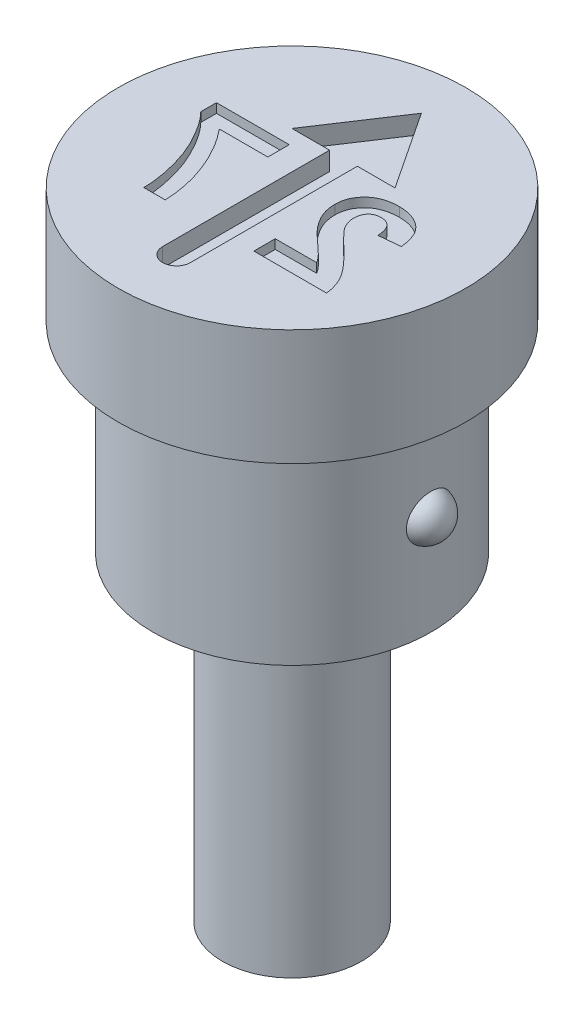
ISO-10303-21;
HEADER;
FILE_DESCRIPTION(('STEP AP214'),'2;1');
FILE_NAME('part.step','',(''),(''),'','','');
FILE_SCHEMA(('AUTOMOTIVE_DESIGN { 1 0 10303 214 1 1 1 1 }'));
ENDSEC;
DATA;
#1=APPLICATION_CONTEXT('core data for automotive mechanical design processes');
#2=APPLICATION_PROTOCOL_DEFINITION('international standard','automotive_design',2000,#1);
#3=PRODUCT_CONTEXT('',#1,'mechanical');
#4=PRODUCT('Part','Part','',(#3));
#5=PRODUCT_RELATED_PRODUCT_CATEGORY('part','',(#4));
#6=PRODUCT_DEFINITION_FORMATION('','',#4);
#7=PRODUCT_DEFINITION_CONTEXT('part definition',#1,'design');
#8=PRODUCT_DEFINITION('design','',#6,#7);
#9=PRODUCT_DEFINITION_SHAPE('','',#8);
#10=(LENGTH_UNIT() NAMED_UNIT(*) SI_UNIT(.MILLI.,.METRE.));
#11=(NAMED_UNIT(*) PLANE_ANGLE_UNIT() SI_UNIT($,.RADIAN.));
#12=(NAMED_UNIT(*) SI_UNIT($,.STERADIAN.) SOLID_ANGLE_UNIT());
#13=UNCERTAINTY_MEASURE_WITH_UNIT(LENGTH_MEASURE(1.E-05),#10,'distance_accuracy_value','');
#14=(GEOMETRIC_REPRESENTATION_CONTEXT(3) GLOBAL_UNCERTAINTY_ASSIGNED_CONTEXT((#13)) GLOBAL_UNIT_ASSIGNED_CONTEXT((#10,
#11,#12)) REPRESENTATION_CONTEXT('',''));
#15=CARTESIAN_POINT('',(0.,0.,0.));
#16=DIRECTION('',(0.,0.,1.));
#17=DIRECTION('',(1.,0.,0.));
#18=AXIS2_PLACEMENT_3D('',#15,#16,#17);
#19=CARTESIAN_POINT('',(0.,0.,0.));
#20=DIRECTION('',(0.,1.,0.));
#21=DIRECTION('',(0.,0.,1.));
#22=AXIS2_PLACEMENT_3D('',#19,#20,#21);
#23=CYLINDRICAL_SURFACE('',#22,3.);
#24=CARTESIAN_POINT('',(0.,-2.5,0.));
#25=DIRECTION('',(0.,1.,0.));
#26=DIRECTION('',(0.,0.,1.));
#27=AXIS2_PLACEMENT_3D('',#24,#25,#26);
#28=CIRCLE('',#27,3.);
#29=CARTESIAN_POINT('',(0.,-2.5,3.));
#30=VERTEX_POINT('',#29);
#31=EDGE_CURVE('E416',#30,#30,#28,.T.);
#32=ORIENTED_EDGE('',*,*,#31,.F.);
#33=EDGE_LOOP('',(#32));
#34=FACE_BOUND('',#33,.T.);
#35=CARTESIAN_POINT('',(0.,-6.8,0.));
#36=DIRECTION('',(0.,1.,0.));
#37=DIRECTION('',(0.,0.,1.));
#38=AXIS2_PLACEMENT_3D('',#35,#36,#37);
#39=CIRCLE('',#38,3.);
#40=CARTESIAN_POINT('',(0.,-6.8,3.));
#41=VERTEX_POINT('',#40);
#42=EDGE_CURVE('E413',#41,#41,#39,.T.);
#43=ORIENTED_EDGE('',*,*,#42,.T.);
#44=EDGE_LOOP('',(#43));
#45=FACE_BOUND('',#44,.T.);
#46=CARTESIAN_POINT('',(2.95940450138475,-4.65,-0.491858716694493));
#47=CARTESIAN_POINT('',(2.95940496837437,-4.67664071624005,-0.491857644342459));
#48=CARTESIAN_POINT('',(2.95977945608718,-4.70329618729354,-0.489618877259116));
#49=CARTESIAN_POINT('',(2.9612363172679,-4.75585686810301,-0.480727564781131));
#50=CARTESIAN_POINT('',(2.96231934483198,-4.78176136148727,-0.474070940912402));
#51=CARTESIAN_POINT('',(2.96506912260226,-4.83204843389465,-0.456555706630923));
#52=CARTESIAN_POINT('',(2.96673533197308,-4.85643239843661,-0.445700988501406));
#53=CARTESIAN_POINT('',(2.97046590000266,-4.90303381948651,-0.420117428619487));
#54=CARTESIAN_POINT('',(2.97253020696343,-4.92525155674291,-0.405389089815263));
#55=CARTESIAN_POINT('',(2.97685544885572,-4.96717076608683,-0.372306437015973));
#56=CARTESIAN_POINT('',(2.97911826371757,-4.9868425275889,-0.353914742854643));
#57=CARTESIAN_POINT('',(2.98357514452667,-5.02288477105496,-0.314132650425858));
#58=CARTESIAN_POINT('',(2.98576920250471,-5.03925487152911,-0.292741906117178));
#59=CARTESIAN_POINT('',(2.98989532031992,-5.06858029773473,-0.247104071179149));
#60=CARTESIAN_POINT('',(2.9918213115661,-5.08146135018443,-0.22280869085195));
#61=CARTESIAN_POINT('',(2.9951489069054,-5.10305336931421,-0.172397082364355));
#62=CARTESIAN_POINT('',(2.99655047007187,-5.11176401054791,-0.14628071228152));
#63=CARTESIAN_POINT('',(2.99869252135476,-5.12489101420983,-0.0925949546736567));
#64=CARTESIAN_POINT('',(2.99942399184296,-5.12924886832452,-0.065010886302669));
#65=CARTESIAN_POINT('',(3.00011343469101,-5.13335950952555,-0.00949191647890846));
#66=CARTESIAN_POINT('',(3.00007137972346,-5.13311213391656,0.0184429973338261));
#67=CARTESIAN_POINT('',(2.99921625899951,-5.12800585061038,0.0740115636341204));
#68=CARTESIAN_POINT('',(2.99839951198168,-5.12312492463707,0.101643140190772));
#69=CARTESIAN_POINT('',(2.99607992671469,-5.10883989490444,0.155682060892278));
#70=CARTESIAN_POINT('',(2.99457708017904,-5.09943573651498,0.182089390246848));
#71=CARTESIAN_POINT('',(2.99105534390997,-5.07635582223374,0.232885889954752));
#72=CARTESIAN_POINT('',(2.98903717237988,-5.06268600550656,0.25727780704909));
#73=CARTESIAN_POINT('',(2.98471128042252,-5.03142013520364,0.303373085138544));
#74=CARTESIAN_POINT('',(2.98240356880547,-5.01382420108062,0.325076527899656));
#75=CARTESIAN_POINT('',(2.9777840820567,-4.97534295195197,0.364969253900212));
#76=CARTESIAN_POINT('',(2.97547252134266,-4.95448794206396,0.383187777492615));
#77=CARTESIAN_POINT('',(2.9710922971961,-4.90994635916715,0.415790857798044));
#78=CARTESIAN_POINT('',(2.96902360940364,-4.88626007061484,0.430175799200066));
#79=CARTESIAN_POINT('',(2.96540593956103,-4.83717299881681,0.454440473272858));
#80=CARTESIAN_POINT('',(2.96384835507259,-4.81181027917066,0.464395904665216));
#81=CARTESIAN_POINT('',(2.96138465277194,-4.7597331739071,0.479857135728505));
#82=CARTESIAN_POINT('',(2.96047845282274,-4.7330189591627,0.48536349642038));
#83=CARTESIAN_POINT('',(2.95943455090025,-4.67955184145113,0.49168820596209));
#84=CARTESIAN_POINT('',(2.9592823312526,-4.65280966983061,0.492595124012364));
#85=CARTESIAN_POINT('',(2.95972434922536,-4.59955653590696,0.489932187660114));
#86=CARTESIAN_POINT('',(2.96031854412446,-4.57304556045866,0.48636258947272));
#87=CARTESIAN_POINT('',(2.9621787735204,-4.52119937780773,0.47489987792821));
#88=CARTESIAN_POINT('',(2.96344002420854,-4.49585717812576,0.467037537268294));
#89=CARTESIAN_POINT('',(2.96649091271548,-4.44684813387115,0.4472485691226));
#90=CARTESIAN_POINT('',(2.96828057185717,-4.42318135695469,0.43532177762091));
#91=CARTESIAN_POINT('',(2.97221360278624,-4.37791359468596,0.407607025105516));
#92=CARTESIAN_POINT('',(2.97436052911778,-4.35633721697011,0.391779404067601));
#93=CARTESIAN_POINT('',(2.97876028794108,-4.31609846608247,0.356787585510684));
#94=CARTESIAN_POINT('',(2.98101313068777,-4.297436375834,0.337623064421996));
#95=CARTESIAN_POINT('',(2.98542770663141,-4.26315397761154,0.296083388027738));
#96=CARTESIAN_POINT('',(2.98758674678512,-4.24760133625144,0.273652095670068));
#97=CARTESIAN_POINT('',(2.99153030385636,-4.2203973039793,0.226507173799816));
#98=CARTESIAN_POINT('',(2.99331478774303,-4.2087462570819,0.201793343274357));
#99=CARTESIAN_POINT('',(2.99634273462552,-4.18947124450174,0.150347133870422));
#100=CARTESIAN_POINT('',(2.99757688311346,-4.18191617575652,0.123588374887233));
#101=CARTESIAN_POINT('',(2.99932602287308,-4.17131278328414,0.0691693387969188));
#102=CARTESIAN_POINT('',(2.99984097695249,-4.16826469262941,0.0415090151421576));
#103=CARTESIAN_POINT('',(3.00009665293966,-4.16674385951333,-0.0141506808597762));
#104=CARTESIAN_POINT('',(2.99983149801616,-4.16830584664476,-0.0421510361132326));
#105=CARTESIAN_POINT('',(2.99854331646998,-4.17604242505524,-0.0974898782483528));
#106=CARTESIAN_POINT('',(2.99752027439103,-4.18221711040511,-0.124828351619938));
#107=CARTESIAN_POINT('',(2.99482849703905,-4.19903251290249,-0.178084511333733));
#108=CARTESIAN_POINT('',(2.99315929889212,-4.20967643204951,-0.204001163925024));
#109=CARTESIAN_POINT('',(2.98936194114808,-4.23516268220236,-0.253644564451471));
#110=CARTESIAN_POINT('',(2.98723379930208,-4.25000485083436,-0.277371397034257));
#111=CARTESIAN_POINT('',(2.98277324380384,-4.28340527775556,-0.321807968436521));
#112=CARTESIAN_POINT('',(2.98044209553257,-4.30194133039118,-0.342534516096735));
#113=CARTESIAN_POINT('',(2.9758315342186,-4.34229537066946,-0.380517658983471));
#114=CARTESIAN_POINT('',(2.97355212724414,-4.36411374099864,-0.397773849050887));
#115=CARTESIAN_POINT('',(2.96934319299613,-4.41008490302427,-0.428056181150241));
#116=CARTESIAN_POINT('',(2.96740908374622,-4.43419938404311,-0.441139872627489));
#117=CARTESIAN_POINT('',(2.96407821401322,-4.48432496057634,-0.462994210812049));
#118=CARTESIAN_POINT('',(2.96268086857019,-4.51033395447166,-0.471769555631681));
#119=CARTESIAN_POINT('',(2.96090453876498,-4.55538373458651,-0.482767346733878));
#120=CARTESIAN_POINT('',(2.96034508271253,-4.57413779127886,-0.48617108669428));
#121=CARTESIAN_POINT('',(2.95959490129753,-4.61192539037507,-0.49071712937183));
#122=CARTESIAN_POINT('',(2.95940416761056,-4.63095892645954,-0.491859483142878));
#123=CARTESIAN_POINT('',(2.95940450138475,-4.65,-0.491858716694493));
#124=B_SPLINE_CURVE_WITH_KNOTS('',3,(#46,#47,#48,#49,#50,#51,#52,#53,#54,#55,#56,#57,#58,#59,
#60,#61,#62,#63,#64,#65,#66,#67,#68,#69,#70,#71,#72,#73,#74,#75,#76,#77,#78,#79,#80,#81,#82,#83,
#84,#85,#86,#87,#88,#89,#90,#91,#92,#93,#94,#95,#96,#97,#98,#99,#100,#101,#102,#103,#104,#105,
#106,#107,#108,#109,#110,#111,#112,#113,#114,#115,#116,#117,#118,#119,#120,#121,#122,#123),
.UNSPECIFIED.,.T.,.F.,(4,2,2,2,2,2,2,2,2,2,2,2,2,2,2,2,2,2,2,2,2,2,2,2,2,2,2,2,2,2,2,2,2,2,2,2,
2,2,4),(0.,0.0798522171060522,0.159778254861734,0.239630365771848,0.319472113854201,
0.40017464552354,0.480886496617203,0.563201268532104,0.645522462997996,0.728935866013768,
0.812352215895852,0.896166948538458,0.979982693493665,1.06368225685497,1.14737927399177,
1.23033985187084,1.31329210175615,1.3947664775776,1.47623057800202,1.55611984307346,
1.63600453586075,1.71532395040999,1.7946465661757,1.87481157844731,1.95498436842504,
2.03674718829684,2.11851721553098,2.20162306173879,2.2847332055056,2.36847104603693,
2.45221059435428,2.53601024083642,2.61980664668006,2.70311373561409,2.78643054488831,
2.86854279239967,2.95056529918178,3.0076398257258,3.06471306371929),.UNSPECIFIED.);
#125=CARTESIAN_POINT('',(2.95940450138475,-4.65,-0.491858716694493));
#126=VERTEX_POINT('',#125);
#127=EDGE_CURVE('E41',#126,#126,#124,.T.);
#128=ORIENTED_EDGE('',*,*,#127,.T.);
#129=EDGE_LOOP('',(#128));
#130=FACE_BOUND('',#129,.T.);
#131=ADVANCED_FACE('F37',(#34,#45,#130),#23,.T.);
#132=CARTESIAN_POINT('',(0.,0.,0.));
#133=DIRECTION('',(0.,1.,0.));
#134=DIRECTION('',(0.,0.,1.));
#135=AXIS2_PLACEMENT_3D('',#132,#133,#134);
#136=PLANE('',#135);
#137=DIRECTION('',(-1.,0.,0.));
#138=VECTOR('',#137,1.);
#139=CARTESIAN_POINT('',(1.66018385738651,0.,1.12975911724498));
#140=LINE('',#139,#138);
#141=CARTESIAN_POINT('',(1.66018385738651,0.,1.12975911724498));
#142=VERTEX_POINT('',#141);
#143=CARTESIAN_POINT('',(0.768356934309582,0.,1.12975911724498));
#144=VERTEX_POINT('',#143);
#145=EDGE_CURVE('E58',#142,#144,#140,.T.);
#146=ORIENTED_EDGE('',*,*,#145,.F.);
#147=CARTESIAN_POINT('',(1.00104924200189,0.,0.44610527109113));
#148=CARTESIAN_POINT('',(1.00834906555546,0.,0.455299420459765));
#149=CARTESIAN_POINT('',(1.02398359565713,0.,0.474991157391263));
#150=CARTESIAN_POINT('',(1.0505820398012,0.,0.505185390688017));
#151=CARTESIAN_POINT('',(1.08140734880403,0.,0.5381670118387));
#152=CARTESIAN_POINT('',(1.11602412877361,0.,0.574553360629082));
#153=CARTESIAN_POINT('',(1.15557583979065,0.,0.6130558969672));
#154=CARTESIAN_POINT('',(1.19863940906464,0.,0.655284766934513));
#155=CARTESIAN_POINT('',(1.24710975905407,0.,0.699079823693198));
#156=CARTESIAN_POINT('',(1.29731329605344,0.,0.745533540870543));
#157=CARTESIAN_POINT('',(1.34773505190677,0.,0.790746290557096));
#158=CARTESIAN_POINT('',(1.39407991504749,0.,0.833688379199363));
#159=CARTESIAN_POINT('',(1.43617647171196,0.,0.871682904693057));
#160=CARTESIAN_POINT('',(1.47206420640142,0.,0.906827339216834));
#161=CARTESIAN_POINT('',(1.50385402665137,0.,0.936723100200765));
#162=CARTESIAN_POINT('',(1.53040012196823,0.,0.962903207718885));
#163=CARTESIAN_POINT('',(1.5521992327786,0.,0.984733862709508));
#164=CARTESIAN_POINT('',(1.5822370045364,0.,1.01876231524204));
#165=CARTESIAN_POINT('',(1.62045666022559,0.,1.06478581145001));
#166=CARTESIAN_POINT('',(1.64734575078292,0.,1.1087625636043));
#167=CARTESIAN_POINT('',(1.66018385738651,0.,1.12975911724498));
#168=B_SPLINE_CURVE_WITH_KNOTS('',3,(#147,#148,#149,#150,#151,#152,#153,#154,#155,#156,#157,
#158,#159,#160,#161,#162,#163,#164,#165,#166,#167),.UNSPECIFIED.,.F.,.F.,(4,1,1,1,1,1,1,1,1,1,1,
1,1,1,1,1,1,1,4),(0.,0.0369753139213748,0.0791925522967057,0.126700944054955,0.179184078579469,
0.237368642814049,0.300558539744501,0.369153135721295,0.443112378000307,0.516018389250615,
0.582473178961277,0.642136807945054,0.694619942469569,0.740679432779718,0.779589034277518,
0.812073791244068,0.837814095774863,0.922564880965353,1.),.UNSPECIFIED.);
#169=CARTESIAN_POINT('',(1.00104924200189,0.,0.44610527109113));
#170=VERTEX_POINT('',#169);
#171=EDGE_CURVE('E243',#170,#142,#168,.T.);
#172=ORIENTED_EDGE('',*,*,#171,.F.);
#173=CARTESIAN_POINT('',(0.768356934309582,0.,-0.155817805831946));
#174=CARTESIAN_POINT('',(0.768944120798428,0.,-0.129656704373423));
#175=CARTESIAN_POINT('',(0.770109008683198,0.,-0.0777570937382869));
#176=CARTESIAN_POINT('',(0.781261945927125,0.,-0.00103396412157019));
#177=CARTESIAN_POINT('',(0.798301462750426,0.,0.0739199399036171));
#178=CARTESIAN_POINT('',(0.823484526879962,0.,0.147287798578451));
#179=CARTESIAN_POINT('',(0.855406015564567,0.,0.220829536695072));
#180=CARTESIAN_POINT('',(0.896553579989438,0.,0.29471022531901));
#181=CARTESIAN_POINT('',(0.944329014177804,0.,0.371157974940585));
#182=CARTESIAN_POINT('',(0.981735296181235,0.,0.420584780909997));
#183=CARTESIAN_POINT('',(1.00104924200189,0.,0.44610527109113));
#184=B_SPLINE_CURVE_WITH_KNOTS('',3,(#173,#174,#175,#176,#177,#178,#179,#180,#181,#182,#183),
.UNSPECIFIED.,.F.,.F.,(4,1,1,1,1,1,1,1,4),(0.,0.119176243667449,0.236427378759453,
0.352663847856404,0.469086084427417,0.58946290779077,0.717601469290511,0.854189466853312,1.),.UNSPECIFIED.);
#185=CARTESIAN_POINT('',(0.768356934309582,0.,-0.155817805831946));
#186=VERTEX_POINT('',#185);
#187=EDGE_CURVE('E246',#186,#170,#184,.T.);
#188=ORIENTED_EDGE('',*,*,#187,.F.);
#189=CARTESIAN_POINT('',(1.50489539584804,0.,-0.808702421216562));
#190=CARTESIAN_POINT('',(1.47699013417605,0.,-0.808166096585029));
#191=CARTESIAN_POINT('',(1.42264113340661,0.,-0.807121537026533));
#192=CARTESIAN_POINT('',(1.34330124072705,0.,-0.798495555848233));
#193=CARTESIAN_POINT('',(1.26876711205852,0.,-0.783454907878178));
#194=CARTESIAN_POINT('',(1.19838711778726,0.,-0.763531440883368));
#195=CARTESIAN_POINT('',(1.13288402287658,0.,-0.736932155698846));
#196=CARTESIAN_POINT('',(1.07171199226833,0.,-0.704774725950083));
#197=CARTESIAN_POINT('',(1.01583376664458,0.,-0.665838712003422));
#198=CARTESIAN_POINT('',(0.964416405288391,0.,-0.62224746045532));
#199=CARTESIAN_POINT('',(0.918453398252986,0.,-0.574311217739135));
#200=CARTESIAN_POINT('',(0.878193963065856,0.,-0.523179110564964));
#201=CARTESIAN_POINT('',(0.844464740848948,0.,-0.468886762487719));
#202=CARTESIAN_POINT('',(0.816160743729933,0.,-0.412095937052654));
#203=CARTESIAN_POINT('',(0.7951452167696,0.,-0.351892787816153));
#204=CARTESIAN_POINT('',(0.779832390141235,0.,-0.28910975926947));
#205=CARTESIAN_POINT('',(0.7696793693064,0.,-0.223453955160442));
#206=CARTESIAN_POINT('',(0.768802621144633,0.,-0.178612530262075));
#207=CARTESIAN_POINT('',(0.768356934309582,0.,-0.155817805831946));
#208=B_SPLINE_CURVE_WITH_KNOTS('',3,(#189,#190,#191,#192,#193,#194,#195,#196,#197,#198,#199,
#200,#201,#202,#203,#204,#205,#206,#207),.UNSPECIFIED.,.F.,.F.,(4,1,1,1,1,1,1,1,1,1,1,1,1,1,1,1,
4),(0.,0.0756723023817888,0.147381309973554,0.216084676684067,0.28169803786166,
0.345459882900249,0.407485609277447,0.468731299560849,0.529782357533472,0.590032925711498,
0.648548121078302,0.70595351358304,0.763101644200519,0.820289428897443,0.878479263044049,
0.938226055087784,1.),.UNSPECIFIED.);
#209=CARTESIAN_POINT('',(1.50489539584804,0.,-0.808702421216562));
#210=VERTEX_POINT('',#209);
#211=EDGE_CURVE('E552',#210,#186,#208,.T.);
#212=ORIENTED_EDGE('',*,*,#211,.F.);
#213=CARTESIAN_POINT('',(2.27604924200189,0.,-0.0846639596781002));
#214=CARTESIAN_POINT('',(2.27233854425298,0.,-0.115823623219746));
#215=CARTESIAN_POINT('',(2.26514409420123,0.,-0.176237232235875));
#216=CARTESIAN_POINT('',(2.24719022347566,0.,-0.263012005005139));
#217=CARTESIAN_POINT('',(2.22445231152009,0.,-0.343065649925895));
#218=CARTESIAN_POINT('',(2.19584636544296,0.,-0.416249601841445));
#219=CARTESIAN_POINT('',(2.16255470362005,0.,-0.483029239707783));
#220=CARTESIAN_POINT('',(2.1228791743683,0.,-0.542402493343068));
#221=CARTESIAN_POINT('',(2.07820608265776,0.,-0.595027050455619));
#222=CARTESIAN_POINT('',(2.02849682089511,0.,-0.640874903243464));
#223=CARTESIAN_POINT('',(1.97406740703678,0.,-0.680091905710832));
#224=CARTESIAN_POINT('',(1.91695350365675,0.,-0.715099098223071));
#225=CARTESIAN_POINT('',(1.85603894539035,0.,-0.743816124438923));
#226=CARTESIAN_POINT('',(1.79199440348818,0.,-0.767483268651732));
#227=CARTESIAN_POINT('',(1.72484882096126,0.,-0.786397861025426));
#228=CARTESIAN_POINT('',(1.6542916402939,0.,-0.798903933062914));
#229=CARTESIAN_POINT('',(1.58075831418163,0.,-0.807700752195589));
#230=CARTESIAN_POINT('',(1.53056415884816,0.,-0.808363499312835));
#231=CARTESIAN_POINT('',(1.50489539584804,0.,-0.808702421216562));
#232=B_SPLINE_CURVE_WITH_KNOTS('',3,(#213,#214,#215,#216,#217,#218,#219,#220,#221,#222,#223,
#224,#225,#226,#227,#228,#229,#230,#231),.UNSPECIFIED.,.F.,.F.,(4,1,1,1,1,1,1,1,1,1,1,1,1,1,1,1,
4),(0.,0.0794357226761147,0.154013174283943,0.224141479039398,0.289934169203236,
0.352732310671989,0.412725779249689,0.470302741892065,0.527168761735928,0.583502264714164,
0.639948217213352,0.696584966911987,0.753726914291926,0.812707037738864,0.872963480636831,
0.93503486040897,1.),.UNSPECIFIED.);
#233=CARTESIAN_POINT('',(2.27604924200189,0.,-0.0846639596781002));
#234=VERTEX_POINT('',#233);
#235=EDGE_CURVE('E560',#234,#210,#232,.T.);
#236=ORIENTED_EDGE('',*,*,#235,.F.);
#237=DIRECTION('',(0.995240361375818,0.,-0.0974506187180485));
#238=VECTOR('',#237,1.);
#239=CARTESIAN_POINT('',(1.81451078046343,0.,-0.0394716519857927));
#240=LINE('',#239,#238);
#241=CARTESIAN_POINT('',(1.81451078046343,0.,-0.0394716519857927));
#242=VERTEX_POINT('',#241);
#243=EDGE_CURVE('E568',#242,#234,#240,.T.);
#244=ORIENTED_EDGE('',*,*,#243,.F.);
#245=CARTESIAN_POINT('',(1.51451078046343,0.,-0.408702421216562));
#246=CARTESIAN_POINT('',(1.53544414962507,0.,-0.407754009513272));
#247=CARTESIAN_POINT('',(1.57588289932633,0.,-0.405921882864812));
#248=CARTESIAN_POINT('',(1.63335513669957,0.,-0.389916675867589));
#249=CARTESIAN_POINT('',(1.68363273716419,0.,-0.362209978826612));
#250=CARTESIAN_POINT('',(1.71946322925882,0.,-0.330635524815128));
#251=CARTESIAN_POINT('',(1.74366842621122,0.,-0.299931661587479));
#252=CARTESIAN_POINT('',(1.7601610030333,0.,-0.273175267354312));
#253=CARTESIAN_POINT('',(1.77437631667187,0.,-0.242771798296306));
#254=CARTESIAN_POINT('',(1.78697227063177,0.,-0.209063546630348));
#255=CARTESIAN_POINT('',(1.79692165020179,0.,-0.171664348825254));
#256=CARTESIAN_POINT('',(1.80493426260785,0.,-0.130859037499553));
#257=CARTESIAN_POINT('',(1.81139126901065,0.,-0.086428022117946));
#258=CARTESIAN_POINT('',(1.81344471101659,0.,-0.0555186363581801));
#259=CARTESIAN_POINT('',(1.81451078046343,0.,-0.0394716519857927));
#260=B_SPLINE_CURVE_WITH_KNOTS('',3,(#245,#246,#247,#248,#249,#250,#251,#252,#253,#254,#255,
#256,#257,#258,#259),.UNSPECIFIED.,.F.,.F.,(4,1,1,1,1,1,1,1,1,1,1,1,4),(0.,0.116899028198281,
0.225823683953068,0.330086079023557,0.435451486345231,0.490306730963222,0.54824405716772,
0.610766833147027,0.677675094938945,0.749188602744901,0.826858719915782,0.910111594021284,1.),.UNSPECIFIED.);
#261=CARTESIAN_POINT('',(1.51451078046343,0.,-0.408702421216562));
#262=VERTEX_POINT('',#261);
#263=EDGE_CURVE('E574',#262,#242,#260,.T.);
#264=ORIENTED_EDGE('',*,*,#263,.F.);
#265=CARTESIAN_POINT('',(1.22989539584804,0.,-0.0937985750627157));
#266=CARTESIAN_POINT('',(1.2307597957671,0.,-0.117744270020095));
#267=CARTESIAN_POINT('',(1.23239517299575,0.,-0.163047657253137));
#268=CARTESIAN_POINT('',(1.24610809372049,0.,-0.226979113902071));
#269=CARTESIAN_POINT('',(1.27042573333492,0.,-0.281937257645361));
#270=CARTESIAN_POINT('',(1.30390664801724,0.,-0.32809078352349));
#271=CARTESIAN_POINT('',(1.34624333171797,0.,-0.364251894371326));
#272=CARTESIAN_POINT('',(1.39573614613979,0.,-0.390971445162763));
#273=CARTESIAN_POINT('',(1.45310958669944,0.,-0.405743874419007));
#274=CARTESIAN_POINT('',(1.49343502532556,0.,-0.407686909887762));
#275=CARTESIAN_POINT('',(1.51451078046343,0.,-0.408702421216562));
#276=B_SPLINE_CURVE_WITH_KNOTS('',3,(#265,#266,#267,#268,#269,#270,#271,#272,#273,#274,#275),
.UNSPECIFIED.,.F.,.F.,(4,1,1,1,1,1,1,1,4),(0.,0.149140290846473,0.282161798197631,
0.404655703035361,0.521109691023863,0.634416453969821,0.748796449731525,0.868710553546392,1.),.UNSPECIFIED.);
#277=CARTESIAN_POINT('',(1.22989539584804,0.,-0.0937985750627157));
#278=VERTEX_POINT('',#277);
#279=EDGE_CURVE('E579',#278,#262,#276,.T.);
#280=ORIENTED_EDGE('',*,*,#279,.F.);
#281=CARTESIAN_POINT('',(1.3212415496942,0.,0.18360527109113));
#282=CARTESIAN_POINT('',(1.30734566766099,0.,0.160522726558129));
#283=CARTESIAN_POINT('',(1.28054212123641,0.,0.115999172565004));
#284=CARTESIAN_POINT('',(1.25114980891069,0.,0.0459850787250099));
#285=CARTESIAN_POINT('',(1.23350744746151,0.,-0.0240145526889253));
#286=CARTESIAN_POINT('',(1.23108643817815,0.,-0.0707879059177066));
#287=CARTESIAN_POINT('',(1.22989539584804,0.,-0.0937985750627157));
#288=B_SPLINE_CURVE_WITH_KNOTS('',3,(#281,#282,#283,#284,#285,#286,#287),.UNSPECIFIED.,.F.,.F.,
(4,1,1,1,4),(0.,0.272795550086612,0.526191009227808,0.766904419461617,1.),.UNSPECIFIED.);
#289=CARTESIAN_POINT('',(1.3212415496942,0.,0.18360527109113));
#290=VERTEX_POINT('',#289);
#291=EDGE_CURVE('E587',#290,#278,#288,.T.);
#292=ORIENTED_EDGE('',*,*,#291,.F.);
#293=CARTESIAN_POINT('',(1.68854924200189,0.,0.57110527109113));
#294=CARTESIAN_POINT('',(1.664820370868,0.,0.548200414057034));
#295=CARTESIAN_POINT('',(1.6196475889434,0.,0.504596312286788));
#296=CARTESIAN_POINT('',(1.55532145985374,0.,0.442157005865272));
#297=CARTESIAN_POINT('',(1.49877216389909,0.,0.384757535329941));
#298=CARTESIAN_POINT('',(1.44881733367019,0.,0.333885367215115));
#299=CARTESIAN_POINT('',(1.40661099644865,0.,0.288245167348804));
#300=CARTESIAN_POINT('',(1.37159796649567,0.,0.248553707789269));
#301=CARTESIAN_POINT('',(1.34333480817,0.,0.21464935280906));
#302=CARTESIAN_POINT('',(1.32802745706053,0.,0.193140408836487));
#303=CARTESIAN_POINT('',(1.3212415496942,0.,0.18360527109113));
#304=B_SPLINE_CURVE_WITH_KNOTS('',3,(#293,#294,#295,#296,#297,#298,#299,#300,#301,#302,#303),
.UNSPECIFIED.,.F.,.F.,(4,1,1,1,1,1,1,1,4),(0.,0.18509006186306,0.352356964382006,
0.503079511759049,0.637279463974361,0.752473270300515,0.851885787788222,0.934339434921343,1.),.UNSPECIFIED.);
#305=CARTESIAN_POINT('',(1.68854924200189,0.,0.57110527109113));
#306=VERTEX_POINT('',#305);
#307=EDGE_CURVE('E595',#306,#290,#304,.T.);
#308=ORIENTED_EDGE('',*,*,#307,.F.);
#309=CARTESIAN_POINT('',(2.33758770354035,0.,1.59129757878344));
#310=CARTESIAN_POINT('',(2.33227465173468,0.,1.55185242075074));
#311=CARTESIAN_POINT('',(2.32165152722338,0.,1.47298422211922));
#312=CARTESIAN_POINT('',(2.28880862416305,0.,1.35777763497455));
#313=CARTESIAN_POINT('',(2.24497459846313,0.,1.24535568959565));
#314=CARTESIAN_POINT('',(2.19740108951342,0.,1.15387151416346));
#315=CARTESIAN_POINT('',(2.15008396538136,0.,1.08022990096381));
#316=CARTESIAN_POINT('',(2.10715313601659,0.,1.01988739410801));
#317=CARTESIAN_POINT('',(2.05593823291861,0.,0.955685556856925));
#318=CARTESIAN_POINT('',(1.99718243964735,0.,0.887106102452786));
#319=CARTESIAN_POINT('',(1.93121046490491,0.,0.813934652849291));
#320=CARTESIAN_POINT('',(1.8575301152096,0.,0.736443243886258));
#321=CARTESIAN_POINT('',(1.77578992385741,0.,0.655002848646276));
#322=CARTESIAN_POINT('',(1.71828424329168,0.,0.599700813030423));
#323=CARTESIAN_POINT('',(1.68854924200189,0.,0.57110527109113));
#324=B_SPLINE_CURVE_WITH_KNOTS('',3,(#309,#310,#311,#312,#313,#314,#315,#316,#317,#318,#319,
#320,#321,#322,#323),.UNSPECIFIED.,.F.,.F.,(4,1,1,1,1,1,1,1,1,1,1,1,4),(0.,0.0963574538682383,
0.192660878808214,0.289454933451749,0.388479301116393,0.441921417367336,0.501521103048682,
0.567882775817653,0.640891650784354,0.72037065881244,0.806636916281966,0.900015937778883,1.),.UNSPECIFIED.);
#325=CARTESIAN_POINT('',(2.33758770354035,0.,1.59129757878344));
#326=VERTEX_POINT('',#325);
#327=EDGE_CURVE('E603',#326,#306,#324,.T.);
#328=ORIENTED_EDGE('',*,*,#327,.F.);
#329=DIRECTION('',(1.,0.,0.));
#330=VECTOR('',#329,1.);
#331=CARTESIAN_POINT('',(0.768356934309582,0.,1.59129757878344));
#332=LINE('',#331,#330);
#333=CARTESIAN_POINT('',(0.768356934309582,0.,1.59129757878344));
#334=VERTEX_POINT('',#333);
#335=EDGE_CURVE('E611',#334,#326,#332,.T.);
#336=ORIENTED_EDGE('',*,*,#335,.F.);
#337=DIRECTION('',(0.,0.,1.));
#338=VECTOR('',#337,1.);
#339=CARTESIAN_POINT('',(0.768356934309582,0.,1.12975911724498));
#340=LINE('',#339,#338);
#341=EDGE_CURVE('E617',#144,#334,#340,.T.);
#342=ORIENTED_EDGE('',*,*,#341,.F.);
#343=EDGE_LOOP('',(#146,#172,#188,#212,#236,#244,#264,#280,#292,#308,#328,#336,#342));
#344=FACE_BOUND('',#343,.T.);
#345=DIRECTION('',(1.,0.,0.));
#346=VECTOR('',#345,1.);
#347=CARTESIAN_POINT('',(-1.88443152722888,0.,-0.316394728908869));
#348=LINE('',#347,#346);
#349=CARTESIAN_POINT('',(-1.88443152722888,0.,-0.316394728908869));
#350=VERTEX_POINT('',#349);
#351=CARTESIAN_POINT('',(-0.837796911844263,0.,-0.316394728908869));
#352=VERTEX_POINT('',#351);
#353=EDGE_CURVE('E66',#350,#352,#348,.T.);
#354=ORIENTED_EDGE('',*,*,#353,.F.);
#355=CARTESIAN_POINT('',(-1.14548921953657,0.,1.59129757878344));
#356=CARTESIAN_POINT('',(-1.14703249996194,0.,1.55041069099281));
#357=CARTESIAN_POINT('',(-1.15013620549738,0.,1.46818269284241));
#358=CARTESIAN_POINT('',(-1.16174856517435,0.,1.34476115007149));
#359=CARTESIAN_POINT('',(-1.17998702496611,0.,1.2208800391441));
#360=CARTESIAN_POINT('',(-1.20264041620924,0.,1.09625304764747));
#361=CARTESIAN_POINT('',(-1.23254853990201,0.,0.971183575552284));
#362=CARTESIAN_POINT('',(-1.26668287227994,0.,0.845208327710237));
#363=CARTESIAN_POINT('',(-1.30803148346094,0.,0.719000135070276));
#364=CARTESIAN_POINT('',(-1.35438216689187,0.,0.592800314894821));
#365=CARTESIAN_POINT('',(-1.40555088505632,0.,0.467807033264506));
#366=CARTESIAN_POINT('',(-1.46131758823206,0.,0.34557061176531));
#367=CARTESIAN_POINT('',(-1.52153811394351,0.,0.226853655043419));
#368=CARTESIAN_POINT('',(-1.5854293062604,0.,0.111239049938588));
#369=CARTESIAN_POINT('',(-1.65373444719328,0.,-0.000901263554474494));
#370=CARTESIAN_POINT('',(-1.72650496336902,0.,-0.109445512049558));
#371=CARTESIAN_POINT('',(-1.80270862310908,0.,-0.215178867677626));
#372=CARTESIAN_POINT('',(-1.85719514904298,0.,-0.282661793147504));
#373=CARTESIAN_POINT('',(-1.88443152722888,0.,-0.316394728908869));
#374=B_SPLINE_CURVE_WITH_KNOTS('',3,(#355,#356,#357,#358,#359,#360,#361,#362,#363,#364,#365,
#366,#367,#368,#369,#370,#371,#372,#373),.UNSPECIFIED.,.F.,.F.,(4,1,1,1,1,1,1,1,1,1,1,1,1,1,1,1,
4),(0.,0.0589531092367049,0.118561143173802,0.178522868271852,0.239353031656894,
0.301026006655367,0.363773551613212,0.427382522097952,0.492333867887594,0.557475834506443,
0.621960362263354,0.685889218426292,0.749254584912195,0.812267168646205,0.875035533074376,
0.937533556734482,1.),.UNSPECIFIED.);
#375=CARTESIAN_POINT('',(-1.14548921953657,0.,1.59129757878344));
#376=VERTEX_POINT('',#375);
#377=EDGE_CURVE('E328',#376,#350,#374,.T.);
#378=ORIENTED_EDGE('',*,*,#377,.F.);
#379=DIRECTION('',(1.,0.,0.));
#380=VECTOR('',#379,1.);
#381=CARTESIAN_POINT('',(-1.60702768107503,0.,1.59129757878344));
#382=LINE('',#381,#380);
#383=CARTESIAN_POINT('',(-1.60702768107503,0.,1.59129757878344));
#384=VERTEX_POINT('',#383);
#385=EDGE_CURVE('E322',#384,#376,#382,.T.);
#386=ORIENTED_EDGE('',*,*,#385,.F.);
#387=CARTESIAN_POINT('',(-2.40702768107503,0.,-0.439471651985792));
#388=CARTESIAN_POINT('',(-2.39065764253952,0.,-0.422815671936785));
#389=CARTESIAN_POINT('',(-2.35700554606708,0.,-0.388575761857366));
#390=CARTESIAN_POINT('',(-2.30880220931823,0.,-0.33253874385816));
#391=CARTESIAN_POINT('',(-2.25988467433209,0.,-0.271728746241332));
#392=CARTESIAN_POINT('',(-2.21127585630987,0.,-0.205326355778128));
#393=CARTESIAN_POINT('',(-2.1614647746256,0.,-0.134380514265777));
#394=CARTESIAN_POINT('',(-2.11264045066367,0.,-0.0575312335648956));
#395=CARTESIAN_POINT('',(-2.06312166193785,0.,0.0242245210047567));
#396=CARTESIAN_POINT('',(-1.99645371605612,0.,0.139868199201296));
#397=CARTESIAN_POINT('',(-1.91852720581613,0.,0.290934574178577));
#398=CARTESIAN_POINT('',(-1.83608508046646,0.,0.478717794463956));
#399=CARTESIAN_POINT('',(-1.76584816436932,0.,0.6722680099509));
#400=CARTESIAN_POINT('',(-1.71775300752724,0.,0.837187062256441));
#401=CARTESIAN_POINT('',(-1.6852569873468,0.,0.969369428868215));
#402=CARTESIAN_POINT('',(-1.6640256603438,0.,1.06602430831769));
#403=CARTESIAN_POINT('',(-1.64615338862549,0.,1.15995919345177));
#404=CARTESIAN_POINT('',(-1.63161430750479,0.,1.25133917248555));
#405=CARTESIAN_POINT('',(-1.62076338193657,0.,1.34020593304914));
#406=CARTESIAN_POINT('',(-1.61218930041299,0.,1.4262505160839));
#407=CARTESIAN_POINT('',(-1.60795920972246,0.,1.50968274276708));
#408=CARTESIAN_POINT('',(-1.60733501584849,0.,1.56437078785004));
#409=CARTESIAN_POINT('',(-1.60702768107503,0.,1.59129757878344));
#410=B_SPLINE_CURVE_WITH_KNOTS('',3,(#387,#388,#389,#390,#391,#392,#393,#394,#395,#396,#397,
#398,#399,#400,#401,#402,#403,#404,#405,#406,#407,#408,#409),.UNSPECIFIED.,.F.,.F.,(4,1,1,1,1,1,
1,1,1,1,1,1,1,1,1,1,1,1,1,1,4),(0.,0.0314272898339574,0.0646054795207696,0.0994393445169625,
0.136456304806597,0.175351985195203,0.216100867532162,0.258977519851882,0.304007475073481,
0.395756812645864,0.487615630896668,0.579873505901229,0.672707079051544,0.718694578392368,
0.76307923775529,0.805893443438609,0.847386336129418,0.88760014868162,0.926386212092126,
0.963754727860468,1.),.UNSPECIFIED.);
#411=CARTESIAN_POINT('',(-2.40702768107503,0.,-0.439471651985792));
#412=VERTEX_POINT('',#411);
#413=EDGE_CURVE('E317',#412,#384,#410,.T.);
#414=ORIENTED_EDGE('',*,*,#413,.F.);
#415=DIRECTION('',(0.,0.,1.));
#416=VECTOR('',#415,1.);
#417=CARTESIAN_POINT('',(-2.40702768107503,0.,-0.777933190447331));
#418=LINE('',#417,#416);
#419=CARTESIAN_POINT('',(-2.40702768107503,0.,-0.777933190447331));
#420=VERTEX_POINT('',#419);
#421=EDGE_CURVE('E314',#420,#412,#418,.T.);
#422=ORIENTED_EDGE('',*,*,#421,.F.);
#423=DIRECTION('',(-1.,0.,0.));
#424=VECTOR('',#423,1.);
#425=CARTESIAN_POINT('',(-0.837796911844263,0.,-0.777933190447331));
#426=LINE('',#425,#424);
#427=CARTESIAN_POINT('',(-0.837796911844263,0.,-0.777933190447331));
#428=VERTEX_POINT('',#427);
#429=EDGE_CURVE('E311',#428,#420,#426,.T.);
#430=ORIENTED_EDGE('',*,*,#429,.F.);
#431=DIRECTION('',(0.,0.,-1.));
#432=VECTOR('',#431,1.);
#433=CARTESIAN_POINT('',(-0.837796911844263,0.,-0.316394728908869));
#434=LINE('',#433,#432);
#435=EDGE_CURVE('E308',#352,#428,#434,.T.);
#436=ORIENTED_EDGE('',*,*,#435,.F.);
#437=EDGE_LOOP('',(#354,#378,#386,#414,#422,#430,#436));
#438=FACE_BOUND('',#437,.T.);
#439=DIRECTION('',(-0.551936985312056,0.,-0.833885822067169));
#440=VECTOR('',#439,1.);
#441=CARTESIAN_POINT('',(1.11196774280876,0.,-1.11));
#442=LINE('',#441,#440);
#443=CARTESIAN_POINT('',(1.11196774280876,0.,-1.11));
#444=VERTEX_POINT('',#443);
#445=CARTESIAN_POINT('',(0.,0.,-2.79));
#446=VERTEX_POINT('',#445);
#447=EDGE_CURVE('E373',#444,#446,#442,.T.);
#448=ORIENTED_EDGE('',*,*,#447,.F.);
#449=DIRECTION('',(1.,0.,0.));
#450=VECTOR('',#449,1.);
#451=CARTESIAN_POINT('',(0.3,0.,-1.11));
#452=LINE('',#451,#450);
#453=CARTESIAN_POINT('',(0.3,0.,-1.11));
#454=VERTEX_POINT('',#453);
#455=EDGE_CURVE('E354',#454,#444,#452,.T.);
#456=ORIENTED_EDGE('',*,*,#455,.F.);
#457=DIRECTION('',(0.,0.,-1.));
#458=VECTOR('',#457,1.);
#459=CARTESIAN_POINT('',(0.300000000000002,0.,2.49));
#460=LINE('',#459,#458);
#461=CARTESIAN_POINT('',(0.300000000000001,0.,2.49));
#462=VERTEX_POINT('',#461);
#463=EDGE_CURVE('E388',#462,#454,#460,.T.);
#464=ORIENTED_EDGE('',*,*,#463,.F.);
#465=CARTESIAN_POINT('',(0.,0.,2.49));
#466=DIRECTION('',(0.,1.,0.));
#467=DIRECTION('',(0.,0.,1.));
#468=AXIS2_PLACEMENT_3D('',#465,#466,#467);
#469=CIRCLE('',#468,0.300000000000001);
#470=CARTESIAN_POINT('',(-0.3,0.,2.49));
#471=VERTEX_POINT('',#470);
#472=EDGE_CURVE('E385',#471,#462,#469,.T.);
#473=ORIENTED_EDGE('',*,*,#472,.F.);
#474=DIRECTION('',(0.,0.,1.));
#475=VECTOR('',#474,1.);
#476=CARTESIAN_POINT('',(-0.300000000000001,0.,-1.11));
#477=LINE('',#476,#475);
#478=CARTESIAN_POINT('',(-0.300000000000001,0.,-1.11));
#479=VERTEX_POINT('',#478);
#480=EDGE_CURVE('E382',#479,#471,#477,.T.);
#481=ORIENTED_EDGE('',*,*,#480,.F.);
#482=DIRECTION('',(1.,0.,0.));
#483=VECTOR('',#482,1.);
#484=CARTESIAN_POINT('',(-1.11196774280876,0.,-1.11));
#485=LINE('',#484,#483);
#486=CARTESIAN_POINT('',(-1.11196774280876,0.,-1.11));
#487=VERTEX_POINT('',#486);
#488=EDGE_CURVE('E379',#487,#479,#485,.T.);
#489=ORIENTED_EDGE('',*,*,#488,.F.);
#490=DIRECTION('',(-0.551936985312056,0.,0.83388582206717));
#491=VECTOR('',#490,1.);
#492=CARTESIAN_POINT('',(0.,0.,-2.79));
#493=LINE('',#492,#491);
#494=EDGE_CURVE('E375',#446,#487,#493,.T.);
#495=ORIENTED_EDGE('',*,*,#494,.F.);
#496=EDGE_LOOP('',(#448,#456,#464,#473,#481,#489,#495));
#497=FACE_BOUND('',#496,.T.);
#498=CARTESIAN_POINT('',(0.,0.,0.));
#499=DIRECTION('',(0.,1.,0.));
#500=DIRECTION('',(0.,0.,1.));
#501=AXIS2_PLACEMENT_3D('',#498,#499,#500);
#502=CIRCLE('',#501,3.75);
#503=CARTESIAN_POINT('',(0.,0.,3.75));
#504=VERTEX_POINT('',#503);
#505=EDGE_CURVE('E11',#504,#504,#502,.T.);
#506=ORIENTED_EDGE('',*,*,#505,.T.);
#507=EDGE_LOOP('',(#506));
#508=FACE_BOUND('',#507,.T.);
#509=ADVANCED_FACE('F39',(#344,#438,#497,#508),#136,.T.);
#510=CARTESIAN_POINT('',(0.,0.,0.));
#511=DIRECTION('',(0.,1.,0.));
#512=DIRECTION('',(0.,0.,1.));
#513=AXIS2_PLACEMENT_3D('',#510,#511,#512);
#514=CYLINDRICAL_SURFACE('',#513,3.75);
#515=CARTESIAN_POINT('',(0.,-2.5,0.));
#516=DIRECTION('',(0.,1.,0.));
#517=DIRECTION('',(0.,0.,1.));
#518=AXIS2_PLACEMENT_3D('',#515,#516,#517);
#519=CIRCLE('',#518,3.75);
#520=CARTESIAN_POINT('',(0.,-2.5,3.75));
#521=VERTEX_POINT('',#520);
#522=EDGE_CURVE('E51',#521,#521,#519,.T.);
#523=ORIENTED_EDGE('',*,*,#522,.T.);
#524=EDGE_LOOP('',(#523));
#525=FACE_BOUND('',#524,.T.);
#526=ORIENTED_EDGE('',*,*,#505,.F.);
#527=EDGE_LOOP('',(#526));
#528=FACE_BOUND('',#527,.T.);
#529=ADVANCED_FACE('F422',(#525,#528),#514,.T.);
#530=CARTESIAN_POINT('',(-3.75,-2.5,0.));
#531=DIRECTION('',(0.,-1.,0.));
#532=DIRECTION('',(0.,0.,-1.));
#533=AXIS2_PLACEMENT_3D('',#530,#531,#532);
#534=PLANE('',#533);
#535=ORIENTED_EDGE('',*,*,#31,.T.);
#536=EDGE_LOOP('',(#535));
#537=FACE_BOUND('',#536,.T.);
#538=ORIENTED_EDGE('',*,*,#522,.F.);
#539=EDGE_LOOP('',(#538));
#540=FACE_BOUND('',#539,.T.);
#541=ADVANCED_FACE('F425',(#537,#540),#534,.T.);
#542=CARTESIAN_POINT('',(-3.,-6.8,0.));
#543=DIRECTION('',(0.,-1.,0.));
#544=DIRECTION('',(0.,0.,-1.));
#545=AXIS2_PLACEMENT_3D('',#542,#543,#544);
#546=PLANE('',#545);
#547=CARTESIAN_POINT('',(0.,-6.8,0.));
#548=DIRECTION('',(0.,1.,0.));
#549=DIRECTION('',(0.,0.,1.));
#550=AXIS2_PLACEMENT_3D('',#547,#548,#549);
#551=CIRCLE('',#550,1.5);
#552=CARTESIAN_POINT('',(0.,-6.8,1.5));
#553=VERTEX_POINT('',#552);
#554=EDGE_CURVE('E410',#553,#553,#551,.T.);
#555=ORIENTED_EDGE('',*,*,#554,.T.);
#556=EDGE_LOOP('',(#555));
#557=FACE_BOUND('',#556,.T.);
#558=ORIENTED_EDGE('',*,*,#42,.F.);
#559=EDGE_LOOP('',(#558));
#560=FACE_BOUND('',#559,.T.);
#561=ADVANCED_FACE('F427',(#557,#560),#546,.T.);
#562=CARTESIAN_POINT('',(0.,0.,0.));
#563=DIRECTION('',(0.,1.,0.));
#564=DIRECTION('',(0.,0.,1.));
#565=AXIS2_PLACEMENT_3D('',#562,#563,#564);
#566=CYLINDRICAL_SURFACE('',#565,1.5);
#567=CARTESIAN_POINT('',(0.,-13.7,0.));
#568=DIRECTION('',(0.,1.,0.));
#569=DIRECTION('',(0.,0.,1.));
#570=AXIS2_PLACEMENT_3D('',#567,#568,#569);
#571=CIRCLE('',#570,1.5);
#572=CARTESIAN_POINT('',(0.,-13.7,1.5));
#573=VERTEX_POINT('',#572);
#574=EDGE_CURVE('E395',#573,#573,#571,.T.);
#575=ORIENTED_EDGE('',*,*,#574,.T.);
#576=EDGE_LOOP('',(#575));
#577=FACE_BOUND('',#576,.T.);
#578=ORIENTED_EDGE('',*,*,#554,.F.);
#579=EDGE_LOOP('',(#578));
#580=FACE_BOUND('',#579,.T.);
#581=ADVANCED_FACE('F434',(#577,#580),#566,.T.);
#582=CARTESIAN_POINT('',(-1.5,-13.7,0.));
#583=DIRECTION('',(0.,-1.,0.));
#584=DIRECTION('',(0.,0.,-1.));
#585=AXIS2_PLACEMENT_3D('',#582,#583,#584);
#586=PLANE('',#585);
#587=ORIENTED_EDGE('',*,*,#574,.F.);
#588=EDGE_LOOP('',(#587));
#589=FACE_BOUND('',#588,.T.);
#590=ADVANCED_FACE('F449',(#589),#586,.T.);
#591=CARTESIAN_POINT('',(1.11196774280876,-0.4,-1.11));
#592=DIRECTION('',(0.833885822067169,0.,-0.551936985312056));
#593=DIRECTION('',(-0.551936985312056,0.,-0.833885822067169));
#594=AXIS2_PLACEMENT_3D('',#591,#592,#593);
#595=PLANE('',#594);
#596=ORIENTED_EDGE('',*,*,#447,.T.);
#597=DIRECTION('',(0.,1.,0.));
#598=VECTOR('',#597,1.);
#599=CARTESIAN_POINT('',(0.,-0.4,-2.79));
#600=LINE('',#599,#598);
#601=CARTESIAN_POINT('',(0.,-0.4,-2.79));
#602=VERTEX_POINT('',#601);
#603=EDGE_CURVE('E372',#602,#446,#600,.T.);
#604=ORIENTED_EDGE('',*,*,#603,.F.);
#605=DIRECTION('',(-0.551936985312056,0.,-0.833885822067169));
#606=VECTOR('',#605,1.);
#607=CARTESIAN_POINT('',(1.11196774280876,-0.4,-1.11));
#608=LINE('',#607,#606);
#609=CARTESIAN_POINT('',(1.11196774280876,-0.4,-1.11));
#610=VERTEX_POINT('',#609);
#611=EDGE_CURVE('E350',#610,#602,#608,.T.);
#612=ORIENTED_EDGE('',*,*,#611,.F.);
#613=DIRECTION('',(0.,1.,0.));
#614=VECTOR('',#613,1.);
#615=CARTESIAN_POINT('',(1.11196774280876,-0.4,-1.11));
#616=LINE('',#615,#614);
#617=EDGE_CURVE('E393',#610,#444,#616,.T.);
#618=ORIENTED_EDGE('',*,*,#617,.T.);
#619=EDGE_LOOP('',(#596,#604,#612,#618));
#620=FACE_BOUND('',#619,.T.);
#621=ADVANCED_FACE('F453',(#620),#595,.F.);
#622=CARTESIAN_POINT('',(0.3,-0.4,-1.11));
#623=DIRECTION('',(0.,0.,1.));
#624=DIRECTION('',(1.,0.,0.));
#625=AXIS2_PLACEMENT_3D('',#622,#623,#624);
#626=PLANE('',#625);
#627=ORIENTED_EDGE('',*,*,#455,.T.);
#628=ORIENTED_EDGE('',*,*,#617,.F.);
#629=DIRECTION('',(1.,0.,0.));
#630=VECTOR('',#629,1.);
#631=CARTESIAN_POINT('',(0.3,-0.4,-1.11));
#632=LINE('',#631,#630);
#633=CARTESIAN_POINT('',(0.3,-0.4,-1.11));
#634=VERTEX_POINT('',#633);
#635=EDGE_CURVE('E369',#634,#610,#632,.T.);
#636=ORIENTED_EDGE('',*,*,#635,.F.);
#637=DIRECTION('',(0.,1.,0.));
#638=VECTOR('',#637,1.);
#639=CARTESIAN_POINT('',(0.3,-0.4,-1.11));
#640=LINE('',#639,#638);
#641=EDGE_CURVE('E396',#634,#454,#640,.T.);
#642=ORIENTED_EDGE('',*,*,#641,.T.);
#643=EDGE_LOOP('',(#627,#628,#636,#642));
#644=FACE_BOUND('',#643,.T.);
#645=ADVANCED_FACE('F457',(#644),#626,.F.);
#646=CARTESIAN_POINT('',(0.300000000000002,-0.4,2.49));
#647=DIRECTION('',(1.,0.,0.));
#648=DIRECTION('',(0.,0.,-1.));
#649=AXIS2_PLACEMENT_3D('',#646,#647,#648);
#650=PLANE('',#649);
#651=ORIENTED_EDGE('',*,*,#463,.T.);
#652=ORIENTED_EDGE('',*,*,#641,.F.);
#653=DIRECTION('',(0.,0.,-1.));
#654=VECTOR('',#653,1.);
#655=CARTESIAN_POINT('',(0.300000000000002,-0.4,2.49));
#656=LINE('',#655,#654);
#657=CARTESIAN_POINT('',(0.300000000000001,-0.4,2.49));
#658=VERTEX_POINT('',#657);
#659=EDGE_CURVE('E366',#658,#634,#656,.T.);
#660=ORIENTED_EDGE('',*,*,#659,.F.);
#661=DIRECTION('',(0.,1.,0.));
#662=VECTOR('',#661,1.);
#663=CARTESIAN_POINT('',(0.300000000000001,-0.4,2.49));
#664=LINE('',#663,#662);
#665=EDGE_CURVE('E398',#658,#462,#664,.T.);
#666=ORIENTED_EDGE('',*,*,#665,.T.);
#667=EDGE_LOOP('',(#651,#652,#660,#666));
#668=FACE_BOUND('',#667,.T.);
#669=ADVANCED_FACE('F475',(#668),#650,.F.);
#670=CARTESIAN_POINT('',(0.,-0.4,2.49));
#671=DIRECTION('',(0.,1.,0.));
#672=DIRECTION('',(0.,0.,1.));
#673=AXIS2_PLACEMENT_3D('',#670,#671,#672);
#674=CYLINDRICAL_SURFACE('',#673,0.300000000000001);
#675=ORIENTED_EDGE('',*,*,#472,.T.);
#676=ORIENTED_EDGE('',*,*,#665,.F.);
#677=CARTESIAN_POINT('',(0.,-0.4,2.49));
#678=DIRECTION('',(0.,1.,0.));
#679=DIRECTION('',(0.,0.,1.));
#680=AXIS2_PLACEMENT_3D('',#677,#678,#679);
#681=CIRCLE('',#680,0.300000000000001);
#682=CARTESIAN_POINT('',(-0.3,-0.4,2.49));
#683=VERTEX_POINT('',#682);
#684=EDGE_CURVE('E363',#683,#658,#681,.T.);
#685=ORIENTED_EDGE('',*,*,#684,.F.);
#686=DIRECTION('',(0.,1.,0.));
#687=VECTOR('',#686,1.);
#688=CARTESIAN_POINT('',(-0.3,-0.4,2.49));
#689=LINE('',#688,#687);
#690=EDGE_CURVE('E400',#683,#471,#689,.T.);
#691=ORIENTED_EDGE('',*,*,#690,.T.);
#692=EDGE_LOOP('',(#675,#676,#685,#691));
#693=FACE_BOUND('',#692,.T.);
#694=ADVANCED_FACE('F471',(#693),#674,.F.);
#695=CARTESIAN_POINT('',(-0.300000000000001,-0.4,-1.11));
#696=DIRECTION('',(-1.,0.,0.));
#697=DIRECTION('',(0.,0.,1.));
#698=AXIS2_PLACEMENT_3D('',#695,#696,#697);
#699=PLANE('',#698);
#700=ORIENTED_EDGE('',*,*,#480,.T.);
#701=ORIENTED_EDGE('',*,*,#690,.F.);
#702=DIRECTION('',(0.,0.,1.));
#703=VECTOR('',#702,1.);
#704=CARTESIAN_POINT('',(-0.300000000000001,-0.4,-1.11));
#705=LINE('',#704,#703);
#706=CARTESIAN_POINT('',(-0.300000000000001,-0.4,-1.11));
#707=VERTEX_POINT('',#706);
#708=EDGE_CURVE('E360',#707,#683,#705,.T.);
#709=ORIENTED_EDGE('',*,*,#708,.F.);
#710=DIRECTION('',(0.,1.,0.));
#711=VECTOR('',#710,1.);
#712=CARTESIAN_POINT('',(-0.300000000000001,-0.4,-1.11));
#713=LINE('',#712,#711);
#714=EDGE_CURVE('E402',#707,#479,#713,.T.);
#715=ORIENTED_EDGE('',*,*,#714,.T.);
#716=EDGE_LOOP('',(#700,#701,#709,#715));
#717=FACE_BOUND('',#716,.T.);
#718=ADVANCED_FACE('F467',(#717),#699,.F.);
#719=CARTESIAN_POINT('',(-1.11196774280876,-0.4,-1.11));
#720=DIRECTION('',(0.,0.,1.));
#721=DIRECTION('',(1.,0.,0.));
#722=AXIS2_PLACEMENT_3D('',#719,#720,#721);
#723=PLANE('',#722);
#724=ORIENTED_EDGE('',*,*,#488,.T.);
#725=ORIENTED_EDGE('',*,*,#714,.F.);
#726=DIRECTION('',(1.,0.,0.));
#727=VECTOR('',#726,1.);
#728=CARTESIAN_POINT('',(-1.11196774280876,-0.4,-1.11));
#729=LINE('',#728,#727);
#730=CARTESIAN_POINT('',(-1.11196774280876,-0.4,-1.11));
#731=VERTEX_POINT('',#730);
#732=EDGE_CURVE('E357',#731,#707,#729,.T.);
#733=ORIENTED_EDGE('',*,*,#732,.F.);
#734=DIRECTION('',(0.,1.,0.));
#735=VECTOR('',#734,1.);
#736=CARTESIAN_POINT('',(-1.11196774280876,-0.4,-1.11));
#737=LINE('',#736,#735);
#738=EDGE_CURVE('E404',#731,#487,#737,.T.);
#739=ORIENTED_EDGE('',*,*,#738,.T.);
#740=EDGE_LOOP('',(#724,#725,#733,#739));
#741=FACE_BOUND('',#740,.T.);
#742=ADVANCED_FACE('F463',(#741),#723,.F.);
#743=CARTESIAN_POINT('',(0.,-0.4,-2.79));
#744=DIRECTION('',(-0.83388582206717,0.,-0.551936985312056));
#745=DIRECTION('',(-0.551936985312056,0.,0.83388582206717));
#746=AXIS2_PLACEMENT_3D('',#743,#744,#745);
#747=PLANE('',#746);
#748=ORIENTED_EDGE('',*,*,#494,.T.);
#749=ORIENTED_EDGE('',*,*,#738,.F.);
#750=DIRECTION('',(-0.551936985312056,0.,0.83388582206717));
#751=VECTOR('',#750,1.);
#752=CARTESIAN_POINT('',(0.,-0.4,-2.79));
#753=LINE('',#752,#751);
#754=EDGE_CURVE('E353',#602,#731,#753,.T.);
#755=ORIENTED_EDGE('',*,*,#754,.F.);
#756=ORIENTED_EDGE('',*,*,#603,.T.);
#757=EDGE_LOOP('',(#748,#749,#755,#756));
#758=FACE_BOUND('',#757,.T.);
#759=ADVANCED_FACE('F459',(#758),#747,.F.);
#760=CARTESIAN_POINT('',(0.,-0.4,2.49));
#761=DIRECTION('',(0.,1.,0.));
#762=DIRECTION('',(0.,0.,1.));
#763=AXIS2_PLACEMENT_3D('',#760,#761,#762);
#764=PLANE('',#763);
#765=ORIENTED_EDGE('',*,*,#611,.T.);
#766=ORIENTED_EDGE('',*,*,#754,.T.);
#767=ORIENTED_EDGE('',*,*,#732,.T.);
#768=ORIENTED_EDGE('',*,*,#708,.T.);
#769=ORIENTED_EDGE('',*,*,#684,.T.);
#770=ORIENTED_EDGE('',*,*,#659,.T.);
#771=ORIENTED_EDGE('',*,*,#635,.T.);
#772=EDGE_LOOP('',(#765,#766,#767,#768,#769,#770,#771));
#773=FACE_BOUND('',#772,.T.);
#774=ADVANCED_FACE('F462',(#773),#764,.T.);
#775=CARTESIAN_POINT('',(-1.88443152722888,-0.2,-0.316394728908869));
#776=DIRECTION('',(0.,0.,1.));
#777=DIRECTION('',(1.,0.,0.));
#778=AXIS2_PLACEMENT_3D('',#775,#776,#777);
#779=PLANE('',#778);
#780=ORIENTED_EDGE('',*,*,#353,.T.);
#781=DIRECTION('',(0.,1.,0.));
#782=VECTOR('',#781,1.);
#783=CARTESIAN_POINT('',(-0.837796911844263,-0.2,-0.316394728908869));
#784=LINE('',#783,#782);
#785=CARTESIAN_POINT('',(-0.837796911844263,-0.2,-0.316394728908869));
#786=VERTEX_POINT('',#785);
#787=EDGE_CURVE('E301',#786,#352,#784,.T.);
#788=ORIENTED_EDGE('',*,*,#787,.F.);
#789=DIRECTION('',(1.,0.,0.));
#790=VECTOR('',#789,1.);
#791=CARTESIAN_POINT('',(-1.88443152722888,-0.2,-0.316394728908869));
#792=LINE('',#791,#790);
#793=CARTESIAN_POINT('',(-1.88443152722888,-0.2,-0.316394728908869));
#794=VERTEX_POINT('',#793);
#795=EDGE_CURVE('E333',#794,#786,#792,.T.);
#796=ORIENTED_EDGE('',*,*,#795,.F.);
#797=DIRECTION('',(0.,1.,0.));
#798=VECTOR('',#797,1.);
#799=CARTESIAN_POINT('',(-1.88443152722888,-0.2,-0.316394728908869));
#800=LINE('',#799,#798);
#801=EDGE_CURVE('E334',#794,#350,#800,.T.);
#802=ORIENTED_EDGE('',*,*,#801,.T.);
#803=EDGE_LOOP('',(#780,#788,#796,#802));
#804=FACE_BOUND('',#803,.T.);
#805=ADVANCED_FACE('F291',(#804),#779,.F.);
#806=CARTESIAN_POINT('',(-1.14548921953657,-0.2,1.59129757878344));
#807=CARTESIAN_POINT('',(-1.14703249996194,-0.2,1.55041069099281));
#808=CARTESIAN_POINT('',(-1.15013620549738,-0.2,1.46818269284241));
#809=CARTESIAN_POINT('',(-1.16174856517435,-0.2,1.34476115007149));
#810=CARTESIAN_POINT('',(-1.17998702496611,-0.2,1.2208800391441));
#811=CARTESIAN_POINT('',(-1.20264041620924,-0.2,1.09625304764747));
#812=CARTESIAN_POINT('',(-1.23254853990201,-0.2,0.971183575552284));
#813=CARTESIAN_POINT('',(-1.26668287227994,-0.2,0.845208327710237));
#814=CARTESIAN_POINT('',(-1.30803148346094,-0.2,0.719000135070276));
#815=CARTESIAN_POINT('',(-1.35438216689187,-0.2,0.592800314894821));
#816=CARTESIAN_POINT('',(-1.40555088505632,-0.2,0.467807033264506));
#817=CARTESIAN_POINT('',(-1.46131758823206,-0.2,0.34557061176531));
#818=CARTESIAN_POINT('',(-1.52153811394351,-0.2,0.226853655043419));
#819=CARTESIAN_POINT('',(-1.5854293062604,-0.2,0.111239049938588));
#820=CARTESIAN_POINT('',(-1.65373444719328,-0.2,-0.000901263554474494));
#821=CARTESIAN_POINT('',(-1.72650496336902,-0.2,-0.109445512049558));
#822=CARTESIAN_POINT('',(-1.80270862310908,-0.2,-0.215178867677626));
#823=CARTESIAN_POINT('',(-1.85719514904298,-0.2,-0.282661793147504));
#824=CARTESIAN_POINT('',(-1.88443152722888,-0.2,-0.316394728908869));
#825=B_SPLINE_CURVE_WITH_KNOTS('',3,(#806,#807,#808,#809,#810,#811,#812,#813,#814,#815,#816,
#817,#818,#819,#820,#821,#822,#823,#824),.UNSPECIFIED.,.F.,.F.,(4,1,1,1,1,1,1,1,1,1,1,1,1,1,1,1,
4),(0.,0.0589531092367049,0.118561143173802,0.178522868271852,0.239353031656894,
0.301026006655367,0.363773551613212,0.427382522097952,0.492333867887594,0.557475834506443,
0.621960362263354,0.685889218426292,0.749254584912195,0.812267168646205,0.875035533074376,
0.937533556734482,1.),.UNSPECIFIED.);
#826=DIRECTION('',(0.,1.,0.));
#827=VECTOR('',#826,1.);
#828=SURFACE_OF_LINEAR_EXTRUSION('',#825,#827);
#829=ORIENTED_EDGE('',*,*,#377,.T.);
#830=ORIENTED_EDGE('',*,*,#801,.F.);
#831=CARTESIAN_POINT('',(-1.14548921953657,-0.2,1.59129757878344));
#832=VERTEX_POINT('',#831);
#833=EDGE_CURVE('E294',#832,#794,#825,.T.);
#834=ORIENTED_EDGE('',*,*,#833,.F.);
#835=DIRECTION('',(0.,1.,0.));
#836=VECTOR('',#835,1.);
#837=CARTESIAN_POINT('',(-1.14548921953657,-0.2,1.59129757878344));
#838=LINE('',#837,#836);
#839=EDGE_CURVE('E339',#832,#376,#838,.T.);
#840=ORIENTED_EDGE('',*,*,#839,.T.);
#841=EDGE_LOOP('',(#829,#830,#834,#840));
#842=FACE_BOUND('',#841,.T.);
#843=ADVANCED_FACE('F286',(#842),#828,.F.);
#844=CARTESIAN_POINT('',(-1.60702768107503,-0.2,1.59129757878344));
#845=DIRECTION('',(0.,0.,1.));
#846=DIRECTION('',(1.,0.,0.));
#847=AXIS2_PLACEMENT_3D('',#844,#845,#846);
#848=PLANE('',#847);
#849=ORIENTED_EDGE('',*,*,#385,.T.);
#850=ORIENTED_EDGE('',*,*,#839,.F.);
#851=DIRECTION('',(1.,0.,0.));
#852=VECTOR('',#851,1.);
#853=CARTESIAN_POINT('',(-1.60702768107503,-0.2,1.59129757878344));
#854=LINE('',#853,#852);
#855=CARTESIAN_POINT('',(-1.60702768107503,-0.2,1.59129757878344));
#856=VERTEX_POINT('',#855);
#857=EDGE_CURVE('E302',#856,#832,#854,.T.);
#858=ORIENTED_EDGE('',*,*,#857,.F.);
#859=DIRECTION('',(0.,1.,0.));
#860=VECTOR('',#859,1.);
#861=CARTESIAN_POINT('',(-1.60702768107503,-0.2,1.59129757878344));
#862=LINE('',#861,#860);
#863=EDGE_CURVE('E341',#856,#384,#862,.T.);
#864=ORIENTED_EDGE('',*,*,#863,.T.);
#865=EDGE_LOOP('',(#849,#850,#858,#864));
#866=FACE_BOUND('',#865,.T.);
#867=ADVANCED_FACE('F290',(#866),#848,.F.);
#868=CARTESIAN_POINT('',(-2.40702768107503,-0.2,-0.439471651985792));
#869=CARTESIAN_POINT('',(-2.39065764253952,-0.2,-0.422815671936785));
#870=CARTESIAN_POINT('',(-2.35700554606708,-0.2,-0.388575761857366));
#871=CARTESIAN_POINT('',(-2.30880220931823,-0.2,-0.33253874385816));
#872=CARTESIAN_POINT('',(-2.25988467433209,-0.2,-0.271728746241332));
#873=CARTESIAN_POINT('',(-2.21127585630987,-0.2,-0.205326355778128));
#874=CARTESIAN_POINT('',(-2.1614647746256,-0.2,-0.134380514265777));
#875=CARTESIAN_POINT('',(-2.11264045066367,-0.2,-0.0575312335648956));
#876=CARTESIAN_POINT('',(-2.06312166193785,-0.2,0.0242245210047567));
#877=CARTESIAN_POINT('',(-1.99645371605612,-0.2,0.139868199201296));
#878=CARTESIAN_POINT('',(-1.91852720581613,-0.2,0.290934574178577));
#879=CARTESIAN_POINT('',(-1.83608508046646,-0.2,0.478717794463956));
#880=CARTESIAN_POINT('',(-1.76584816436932,-0.2,0.6722680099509));
#881=CARTESIAN_POINT('',(-1.71775300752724,-0.2,0.837187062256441));
#882=CARTESIAN_POINT('',(-1.6852569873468,-0.2,0.969369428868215));
#883=CARTESIAN_POINT('',(-1.6640256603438,-0.2,1.06602430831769));
#884=CARTESIAN_POINT('',(-1.64615338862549,-0.2,1.15995919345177));
#885=CARTESIAN_POINT('',(-1.63161430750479,-0.2,1.25133917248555));
#886=CARTESIAN_POINT('',(-1.62076338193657,-0.2,1.34020593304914));
#887=CARTESIAN_POINT('',(-1.61218930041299,-0.2,1.4262505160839));
#888=CARTESIAN_POINT('',(-1.60795920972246,-0.2,1.50968274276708));
#889=CARTESIAN_POINT('',(-1.60733501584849,-0.2,1.56437078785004));
#890=CARTESIAN_POINT('',(-1.60702768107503,-0.2,1.59129757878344));
#891=B_SPLINE_CURVE_WITH_KNOTS('',3,(#868,#869,#870,#871,#872,#873,#874,#875,#876,#877,#878,
#879,#880,#881,#882,#883,#884,#885,#886,#887,#888,#889,#890),.UNSPECIFIED.,.F.,.F.,(4,1,1,1,1,1,
1,1,1,1,1,1,1,1,1,1,1,1,1,1,4),(0.,0.0314272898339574,0.0646054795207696,0.0994393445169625,
0.136456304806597,0.175351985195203,0.216100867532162,0.258977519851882,0.304007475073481,
0.395756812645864,0.487615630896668,0.579873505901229,0.672707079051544,0.718694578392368,
0.76307923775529,0.805893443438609,0.847386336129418,0.88760014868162,0.926386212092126,
0.963754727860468,1.),.UNSPECIFIED.);
#892=DIRECTION('',(0.,1.,0.));
#893=VECTOR('',#892,1.);
#894=SURFACE_OF_LINEAR_EXTRUSION('',#891,#893);
#895=ORIENTED_EDGE('',*,*,#413,.T.);
#896=ORIENTED_EDGE('',*,*,#863,.F.);
#897=CARTESIAN_POINT('',(-2.40702768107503,-0.2,-0.439471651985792));
#898=VERTEX_POINT('',#897);
#899=EDGE_CURVE('E501',#898,#856,#891,.T.);
#900=ORIENTED_EDGE('',*,*,#899,.F.);
#901=DIRECTION('',(0.,1.,0.));
#902=VECTOR('',#901,1.);
#903=CARTESIAN_POINT('',(-2.40702768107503,-0.2,-0.439471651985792));
#904=LINE('',#903,#902);
#905=EDGE_CURVE('E343',#898,#412,#904,.T.);
#906=ORIENTED_EDGE('',*,*,#905,.T.);
#907=EDGE_LOOP('',(#895,#896,#900,#906));
#908=FACE_BOUND('',#907,.T.);
#909=ADVANCED_FACE('F497',(#908),#894,.F.);
#910=CARTESIAN_POINT('',(-2.40702768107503,-0.2,-0.777933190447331));
#911=DIRECTION('',(-1.,0.,0.));
#912=DIRECTION('',(0.,0.,1.));
#913=AXIS2_PLACEMENT_3D('',#910,#911,#912);
#914=PLANE('',#913);
#915=ORIENTED_EDGE('',*,*,#421,.T.);
#916=ORIENTED_EDGE('',*,*,#905,.F.);
#917=DIRECTION('',(0.,0.,1.));
#918=VECTOR('',#917,1.);
#919=CARTESIAN_POINT('',(-2.40702768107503,-0.2,-0.777933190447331));
#920=LINE('',#919,#918);
#921=CARTESIAN_POINT('',(-2.40702768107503,-0.2,-0.777933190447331));
#922=VERTEX_POINT('',#921);
#923=EDGE_CURVE('E507',#922,#898,#920,.T.);
#924=ORIENTED_EDGE('',*,*,#923,.F.);
#925=DIRECTION('',(0.,1.,0.));
#926=VECTOR('',#925,1.);
#927=CARTESIAN_POINT('',(-2.40702768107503,-0.2,-0.777933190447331));
#928=LINE('',#927,#926);
#929=EDGE_CURVE('E345',#922,#420,#928,.T.);
#930=ORIENTED_EDGE('',*,*,#929,.T.);
#931=EDGE_LOOP('',(#915,#916,#924,#930));
#932=FACE_BOUND('',#931,.T.);
#933=ADVANCED_FACE('F494',(#932),#914,.F.);
#934=CARTESIAN_POINT('',(-0.837796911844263,-0.2,-0.777933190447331));
#935=DIRECTION('',(0.,0.,-1.));
#936=DIRECTION('',(-1.,0.,0.));
#937=AXIS2_PLACEMENT_3D('',#934,#935,#936);
#938=PLANE('',#937);
#939=ORIENTED_EDGE('',*,*,#429,.T.);
#940=ORIENTED_EDGE('',*,*,#929,.F.);
#941=DIRECTION('',(-1.,0.,0.));
#942=VECTOR('',#941,1.);
#943=CARTESIAN_POINT('',(-0.837796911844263,-0.2,-0.777933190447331));
#944=LINE('',#943,#942);
#945=CARTESIAN_POINT('',(-0.837796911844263,-0.2,-0.777933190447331));
#946=VERTEX_POINT('',#945);
#947=EDGE_CURVE('E513',#946,#922,#944,.T.);
#948=ORIENTED_EDGE('',*,*,#947,.F.);
#949=DIRECTION('',(0.,1.,0.));
#950=VECTOR('',#949,1.);
#951=CARTESIAN_POINT('',(-0.837796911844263,-0.2,-0.777933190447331));
#952=LINE('',#951,#950);
#953=EDGE_CURVE('E347',#946,#428,#952,.T.);
#954=ORIENTED_EDGE('',*,*,#953,.T.);
#955=EDGE_LOOP('',(#939,#940,#948,#954));
#956=FACE_BOUND('',#955,.T.);
#957=ADVANCED_FACE('F490',(#956),#938,.F.);
#958=CARTESIAN_POINT('',(-0.837796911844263,-0.2,-0.316394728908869));
#959=DIRECTION('',(1.,0.,0.));
#960=DIRECTION('',(0.,0.,-1.));
#961=AXIS2_PLACEMENT_3D('',#958,#959,#960);
#962=PLANE('',#961);
#963=ORIENTED_EDGE('',*,*,#435,.T.);
#964=ORIENTED_EDGE('',*,*,#953,.F.);
#965=DIRECTION('',(0.,0.,-1.));
#966=VECTOR('',#965,1.);
#967=CARTESIAN_POINT('',(-0.837796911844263,-0.2,-0.316394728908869));
#968=LINE('',#967,#966);
#969=EDGE_CURVE('E516',#786,#946,#968,.T.);
#970=ORIENTED_EDGE('',*,*,#969,.F.);
#971=ORIENTED_EDGE('',*,*,#787,.T.);
#972=EDGE_LOOP('',(#963,#964,#970,#971));
#973=FACE_BOUND('',#972,.T.);
#974=ADVANCED_FACE('F284',(#973),#962,.F.);
#975=CARTESIAN_POINT('',(-1.82812617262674,-0.2,0.504950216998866));
#976=DIRECTION('',(0.,1.,0.));
#977=DIRECTION('',(0.,0.,1.));
#978=AXIS2_PLACEMENT_3D('',#975,#976,#977);
#979=PLANE('',#978);
#980=ORIENTED_EDGE('',*,*,#795,.T.);
#981=ORIENTED_EDGE('',*,*,#969,.T.);
#982=ORIENTED_EDGE('',*,*,#947,.T.);
#983=ORIENTED_EDGE('',*,*,#923,.T.);
#984=ORIENTED_EDGE('',*,*,#899,.T.);
#985=ORIENTED_EDGE('',*,*,#857,.T.);
#986=ORIENTED_EDGE('',*,*,#833,.T.);
#987=EDGE_LOOP('',(#980,#981,#982,#983,#984,#985,#986));
#988=FACE_BOUND('',#987,.T.);
#989=ADVANCED_FACE('F281',(#988),#979,.T.);
#990=CARTESIAN_POINT('',(1.66018385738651,-0.2,1.12975911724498));
#991=DIRECTION('',(0.,0.,-1.));
#992=DIRECTION('',(-1.,0.,0.));
#993=AXIS2_PLACEMENT_3D('',#990,#991,#992);
#994=PLANE('',#993);
#995=ORIENTED_EDGE('',*,*,#145,.T.);
#996=DIRECTION('',(0.,1.,0.));
#997=VECTOR('',#996,1.);
#998=CARTESIAN_POINT('',(0.768356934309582,-0.2,1.12975911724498));
#999=LINE('',#998,#997);
#1000=CARTESIAN_POINT('',(0.768356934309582,-0.2,1.12975911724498));
#1001=VERTEX_POINT('',#1000);
#1002=EDGE_CURVE('E220',#1001,#144,#999,.T.);
#1003=ORIENTED_EDGE('',*,*,#1002,.F.);
#1004=DIRECTION('',(-1.,0.,0.));
#1005=VECTOR('',#1004,1.);
#1006=CARTESIAN_POINT('',(1.66018385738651,-0.2,1.12975911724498));
#1007=LINE('',#1006,#1005);
#1008=CARTESIAN_POINT('',(1.66018385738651,-0.2,1.12975911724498));
#1009=VERTEX_POINT('',#1008);
#1010=EDGE_CURVE('E224',#1009,#1001,#1007,.T.);
#1011=ORIENTED_EDGE('',*,*,#1010,.F.);
#1012=DIRECTION('',(0.,1.,0.));
#1013=VECTOR('',#1012,1.);
#1014=CARTESIAN_POINT('',(1.66018385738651,-0.2,1.12975911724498));
#1015=LINE('',#1014,#1013);
#1016=EDGE_CURVE('E376',#1009,#142,#1015,.T.);
#1017=ORIENTED_EDGE('',*,*,#1016,.T.);
#1018=EDGE_LOOP('',(#995,#1003,#1011,#1017));
#1019=FACE_BOUND('',#1018,.T.);
#1020=ADVANCED_FACE('F222',(#1019),#994,.F.);
#1021=CARTESIAN_POINT('',(1.00104924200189,-0.2,0.44610527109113));
#1022=CARTESIAN_POINT('',(1.00834906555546,-0.2,0.455299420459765));
#1023=CARTESIAN_POINT('',(1.02398359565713,-0.2,0.474991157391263));
#1024=CARTESIAN_POINT('',(1.0505820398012,-0.2,0.505185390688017));
#1025=CARTESIAN_POINT('',(1.08140734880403,-0.2,0.5381670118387));
#1026=CARTESIAN_POINT('',(1.11602412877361,-0.2,0.574553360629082));
#1027=CARTESIAN_POINT('',(1.15557583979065,-0.2,0.6130558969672));
#1028=CARTESIAN_POINT('',(1.19863940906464,-0.2,0.655284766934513));
#1029=CARTESIAN_POINT('',(1.24710975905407,-0.2,0.699079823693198));
#1030=CARTESIAN_POINT('',(1.29731329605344,-0.2,0.745533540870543));
#1031=CARTESIAN_POINT('',(1.34773505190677,-0.2,0.790746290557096));
#1032=CARTESIAN_POINT('',(1.39407991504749,-0.2,0.833688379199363));
#1033=CARTESIAN_POINT('',(1.43617647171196,-0.2,0.871682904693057));
#1034=CARTESIAN_POINT('',(1.47206420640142,-0.2,0.906827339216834));
#1035=CARTESIAN_POINT('',(1.50385402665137,-0.2,0.936723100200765));
#1036=CARTESIAN_POINT('',(1.53040012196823,-0.2,0.962903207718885));
#1037=CARTESIAN_POINT('',(1.5521992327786,-0.2,0.984733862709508));
#1038=CARTESIAN_POINT('',(1.5822370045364,-0.2,1.01876231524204));
#1039=CARTESIAN_POINT('',(1.62045666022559,-0.2,1.06478581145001));
#1040=CARTESIAN_POINT('',(1.64734575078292,-0.2,1.1087625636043));
#1041=CARTESIAN_POINT('',(1.66018385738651,-0.2,1.12975911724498));
#1042=B_SPLINE_CURVE_WITH_KNOTS('',3,(#1021,#1022,#1023,#1024,#1025,#1026,#1027,#1028,#1029,
#1030,#1031,#1032,#1033,#1034,#1035,#1036,#1037,#1038,#1039,#1040,#1041),.UNSPECIFIED.,.F.,.F.,
(4,1,1,1,1,1,1,1,1,1,1,1,1,1,1,1,1,1,4),(0.,0.0369753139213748,0.0791925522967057,
0.126700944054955,0.179184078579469,0.237368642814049,0.300558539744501,0.369153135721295,
0.443112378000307,0.516018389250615,0.582473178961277,0.642136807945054,0.694619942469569,
0.740679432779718,0.779589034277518,0.812073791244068,0.837814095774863,0.922564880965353,1.),.UNSPECIFIED.);
#1043=DIRECTION('',(0.,1.,0.));
#1044=VECTOR('',#1043,1.);
#1045=SURFACE_OF_LINEAR_EXTRUSION('',#1042,#1044);
#1046=ORIENTED_EDGE('',*,*,#171,.T.);
#1047=ORIENTED_EDGE('',*,*,#1016,.F.);
#1048=CARTESIAN_POINT('',(1.00104924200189,-0.2,0.44610527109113));
#1049=VERTEX_POINT('',#1048);
#1050=EDGE_CURVE('E230',#1049,#1009,#1042,.T.);
#1051=ORIENTED_EDGE('',*,*,#1050,.F.);
#1052=DIRECTION('',(0.,1.,0.));
#1053=VECTOR('',#1052,1.);
#1054=CARTESIAN_POINT('',(1.00104924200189,-0.2,0.44610527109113));
#1055=LINE('',#1054,#1053);
#1056=EDGE_CURVE('E540',#1049,#170,#1055,.T.);
#1057=ORIENTED_EDGE('',*,*,#1056,.T.);
#1058=EDGE_LOOP('',(#1046,#1047,#1051,#1057));
#1059=FACE_BOUND('',#1058,.T.);
#1060=ADVANCED_FACE('F280',(#1059),#1045,.F.);
#1061=CARTESIAN_POINT('',(0.768356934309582,-0.2,-0.155817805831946));
#1062=CARTESIAN_POINT('',(0.768944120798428,-0.2,-0.129656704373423));
#1063=CARTESIAN_POINT('',(0.770109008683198,-0.2,-0.0777570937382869));
#1064=CARTESIAN_POINT('',(0.781261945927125,-0.2,-0.00103396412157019));
#1065=CARTESIAN_POINT('',(0.798301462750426,-0.2,0.0739199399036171));
#1066=CARTESIAN_POINT('',(0.823484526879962,-0.2,0.147287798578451));
#1067=CARTESIAN_POINT('',(0.855406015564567,-0.2,0.220829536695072));
#1068=CARTESIAN_POINT('',(0.896553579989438,-0.2,0.29471022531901));
#1069=CARTESIAN_POINT('',(0.944329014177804,-0.2,0.371157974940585));
#1070=CARTESIAN_POINT('',(0.981735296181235,-0.2,0.420584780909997));
#1071=CARTESIAN_POINT('',(1.00104924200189,-0.2,0.44610527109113));
#1072=B_SPLINE_CURVE_WITH_KNOTS('',3,(#1061,#1062,#1063,#1064,#1065,#1066,#1067,#1068,#1069,
#1070,#1071),.UNSPECIFIED.,.F.,.F.,(4,1,1,1,1,1,1,1,4),(0.,0.119176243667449,0.236427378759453,
0.352663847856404,0.469086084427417,0.58946290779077,0.717601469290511,0.854189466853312,1.),.UNSPECIFIED.);
#1073=DIRECTION('',(0.,1.,0.));
#1074=VECTOR('',#1073,1.);
#1075=SURFACE_OF_LINEAR_EXTRUSION('',#1072,#1074);
#1076=ORIENTED_EDGE('',*,*,#187,.T.);
#1077=ORIENTED_EDGE('',*,*,#1056,.F.);
#1078=CARTESIAN_POINT('',(0.768356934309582,-0.2,-0.155817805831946));
#1079=VERTEX_POINT('',#1078);
#1080=EDGE_CURVE('E624',#1079,#1049,#1072,.T.);
#1081=ORIENTED_EDGE('',*,*,#1080,.F.);
#1082=DIRECTION('',(0.,1.,0.));
#1083=VECTOR('',#1082,1.);
#1084=CARTESIAN_POINT('',(0.768356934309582,-0.2,-0.155817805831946));
#1085=LINE('',#1084,#1083);
#1086=EDGE_CURVE('E538',#1079,#186,#1085,.T.);
#1087=ORIENTED_EDGE('',*,*,#1086,.T.);
#1088=EDGE_LOOP('',(#1076,#1077,#1081,#1087));
#1089=FACE_BOUND('',#1088,.T.);
#1090=ADVANCED_FACE('F636',(#1089),#1075,.F.);
#1091=CARTESIAN_POINT('',(1.50489539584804,-0.2,-0.808702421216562));
#1092=CARTESIAN_POINT('',(1.47699013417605,-0.2,-0.808166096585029));
#1093=CARTESIAN_POINT('',(1.42264113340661,-0.2,-0.807121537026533));
#1094=CARTESIAN_POINT('',(1.34330124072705,-0.2,-0.798495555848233));
#1095=CARTESIAN_POINT('',(1.26876711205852,-0.2,-0.783454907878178));
#1096=CARTESIAN_POINT('',(1.19838711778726,-0.2,-0.763531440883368));
#1097=CARTESIAN_POINT('',(1.13288402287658,-0.2,-0.736932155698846));
#1098=CARTESIAN_POINT('',(1.07171199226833,-0.2,-0.704774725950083));
#1099=CARTESIAN_POINT('',(1.01583376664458,-0.2,-0.665838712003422));
#1100=CARTESIAN_POINT('',(0.964416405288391,-0.2,-0.62224746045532));
#1101=CARTESIAN_POINT('',(0.918453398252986,-0.2,-0.574311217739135));
#1102=CARTESIAN_POINT('',(0.878193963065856,-0.2,-0.523179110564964));
#1103=CARTESIAN_POINT('',(0.844464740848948,-0.2,-0.468886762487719));
#1104=CARTESIAN_POINT('',(0.816160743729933,-0.2,-0.412095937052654));
#1105=CARTESIAN_POINT('',(0.7951452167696,-0.2,-0.351892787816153));
#1106=CARTESIAN_POINT('',(0.779832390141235,-0.2,-0.28910975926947));
#1107=CARTESIAN_POINT('',(0.7696793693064,-0.2,-0.223453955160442));
#1108=CARTESIAN_POINT('',(0.768802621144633,-0.2,-0.178612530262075));
#1109=CARTESIAN_POINT('',(0.768356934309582,-0.2,-0.155817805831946));
#1110=B_SPLINE_CURVE_WITH_KNOTS('',3,(#1091,#1092,#1093,#1094,#1095,#1096,#1097,#1098,#1099,
#1100,#1101,#1102,#1103,#1104,#1105,#1106,#1107,#1108,#1109),.UNSPECIFIED.,.F.,.F.,(4,1,1,1,1,1,
1,1,1,1,1,1,1,1,1,1,4),(0.,0.0756723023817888,0.147381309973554,0.216084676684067,
0.28169803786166,0.345459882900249,0.407485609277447,0.468731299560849,0.529782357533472,
0.590032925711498,0.648548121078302,0.70595351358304,0.763101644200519,0.820289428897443,
0.878479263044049,0.938226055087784,1.),.UNSPECIFIED.);
#1111=DIRECTION('',(0.,1.,0.));
#1112=VECTOR('',#1111,1.);
#1113=SURFACE_OF_LINEAR_EXTRUSION('',#1110,#1112);
#1114=ORIENTED_EDGE('',*,*,#211,.T.);
#1115=ORIENTED_EDGE('',*,*,#1086,.F.);
#1116=CARTESIAN_POINT('',(1.50489539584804,-0.2,-0.808702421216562));
#1117=VERTEX_POINT('',#1116);
#1118=EDGE_CURVE('E648',#1117,#1079,#1110,.T.);
#1119=ORIENTED_EDGE('',*,*,#1118,.F.);
#1120=DIRECTION('',(0.,1.,0.));
#1121=VECTOR('',#1120,1.);
#1122=CARTESIAN_POINT('',(1.50489539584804,-0.2,-0.808702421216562));
#1123=LINE('',#1122,#1121);
#1124=EDGE_CURVE('E536',#1117,#210,#1123,.T.);
#1125=ORIENTED_EDGE('',*,*,#1124,.T.);
#1126=EDGE_LOOP('',(#1114,#1115,#1119,#1125));
#1127=FACE_BOUND('',#1126,.T.);
#1128=ADVANCED_FACE('F640',(#1127),#1113,.F.);
#1129=CARTESIAN_POINT('',(2.27604924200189,-0.2,-0.0846639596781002));
#1130=CARTESIAN_POINT('',(2.27233854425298,-0.2,-0.115823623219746));
#1131=CARTESIAN_POINT('',(2.26514409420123,-0.2,-0.176237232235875));
#1132=CARTESIAN_POINT('',(2.24719022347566,-0.2,-0.263012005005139));
#1133=CARTESIAN_POINT('',(2.22445231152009,-0.2,-0.343065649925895));
#1134=CARTESIAN_POINT('',(2.19584636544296,-0.2,-0.416249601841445));
#1135=CARTESIAN_POINT('',(2.16255470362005,-0.2,-0.483029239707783));
#1136=CARTESIAN_POINT('',(2.1228791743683,-0.2,-0.542402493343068));
#1137=CARTESIAN_POINT('',(2.07820608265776,-0.2,-0.595027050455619));
#1138=CARTESIAN_POINT('',(2.02849682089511,-0.2,-0.640874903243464));
#1139=CARTESIAN_POINT('',(1.97406740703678,-0.2,-0.680091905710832));
#1140=CARTESIAN_POINT('',(1.91695350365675,-0.2,-0.715099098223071));
#1141=CARTESIAN_POINT('',(1.85603894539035,-0.2,-0.743816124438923));
#1142=CARTESIAN_POINT('',(1.79199440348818,-0.2,-0.767483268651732));
#1143=CARTESIAN_POINT('',(1.72484882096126,-0.2,-0.786397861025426));
#1144=CARTESIAN_POINT('',(1.6542916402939,-0.2,-0.798903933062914));
#1145=CARTESIAN_POINT('',(1.58075831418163,-0.2,-0.807700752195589));
#1146=CARTESIAN_POINT('',(1.53056415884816,-0.2,-0.808363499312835));
#1147=CARTESIAN_POINT('',(1.50489539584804,-0.2,-0.808702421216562));
#1148=B_SPLINE_CURVE_WITH_KNOTS('',3,(#1129,#1130,#1131,#1132,#1133,#1134,#1135,#1136,#1137,
#1138,#1139,#1140,#1141,#1142,#1143,#1144,#1145,#1146,#1147),.UNSPECIFIED.,.F.,.F.,(4,1,1,1,1,1,
1,1,1,1,1,1,1,1,1,1,4),(0.,0.0794357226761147,0.154013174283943,0.224141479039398,
0.289934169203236,0.352732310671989,0.412725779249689,0.470302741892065,0.527168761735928,
0.583502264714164,0.639948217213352,0.696584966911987,0.753726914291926,0.812707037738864,
0.872963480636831,0.93503486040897,1.),.UNSPECIFIED.);
#1149=DIRECTION('',(0.,1.,0.));
#1150=VECTOR('',#1149,1.);
#1151=SURFACE_OF_LINEAR_EXTRUSION('',#1148,#1150);
#1152=ORIENTED_EDGE('',*,*,#235,.T.);
#1153=ORIENTED_EDGE('',*,*,#1124,.F.);
#1154=CARTESIAN_POINT('',(2.27604924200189,-0.2,-0.0846639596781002));
#1155=VERTEX_POINT('',#1154);
#1156=EDGE_CURVE('E653',#1155,#1117,#1148,.T.);
#1157=ORIENTED_EDGE('',*,*,#1156,.F.);
#1158=DIRECTION('',(0.,1.,0.));
#1159=VECTOR('',#1158,1.);
#1160=CARTESIAN_POINT('',(2.27604924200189,-0.2,-0.0846639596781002));
#1161=LINE('',#1160,#1159);
#1162=EDGE_CURVE('E534',#1155,#234,#1161,.T.);
#1163=ORIENTED_EDGE('',*,*,#1162,.T.);
#1164=EDGE_LOOP('',(#1152,#1153,#1157,#1163));
#1165=FACE_BOUND('',#1164,.T.);
#1166=ADVANCED_FACE('F644',(#1165),#1151,.F.);
#1167=CARTESIAN_POINT('',(1.81451078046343,-0.2,-0.0394716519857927));
#1168=DIRECTION('',(0.0974506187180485,0.,0.995240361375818));
#1169=DIRECTION('',(0.995240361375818,0.,-0.0974506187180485));
#1170=AXIS2_PLACEMENT_3D('',#1167,#1168,#1169);
#1171=PLANE('',#1170);
#1172=ORIENTED_EDGE('',*,*,#243,.T.);
#1173=ORIENTED_EDGE('',*,*,#1162,.F.);
#1174=DIRECTION('',(0.995240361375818,0.,-0.0974506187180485));
#1175=VECTOR('',#1174,1.);
#1176=CARTESIAN_POINT('',(1.81451078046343,-0.2,-0.0394716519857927));
#1177=LINE('',#1176,#1175);
#1178=CARTESIAN_POINT('',(1.81451078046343,-0.2,-0.0394716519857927));
#1179=VERTEX_POINT('',#1178);
#1180=EDGE_CURVE('E662',#1179,#1155,#1177,.T.);
#1181=ORIENTED_EDGE('',*,*,#1180,.F.);
#1182=DIRECTION('',(0.,1.,0.));
#1183=VECTOR('',#1182,1.);
#1184=CARTESIAN_POINT('',(1.81451078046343,-0.2,-0.0394716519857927));
#1185=LINE('',#1184,#1183);
#1186=EDGE_CURVE('E532',#1179,#242,#1185,.T.);
#1187=ORIENTED_EDGE('',*,*,#1186,.T.);
#1188=EDGE_LOOP('',(#1172,#1173,#1181,#1187));
#1189=FACE_BOUND('',#1188,.T.);
#1190=ADVANCED_FACE('F686',(#1189),#1171,.F.);
#1191=CARTESIAN_POINT('',(1.51451078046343,-0.2,-0.408702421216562));
#1192=CARTESIAN_POINT('',(1.53544414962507,-0.2,-0.407754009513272));
#1193=CARTESIAN_POINT('',(1.57588289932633,-0.2,-0.405921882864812));
#1194=CARTESIAN_POINT('',(1.63335513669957,-0.2,-0.389916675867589));
#1195=CARTESIAN_POINT('',(1.68363273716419,-0.2,-0.362209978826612));
#1196=CARTESIAN_POINT('',(1.71946322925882,-0.2,-0.330635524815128));
#1197=CARTESIAN_POINT('',(1.74366842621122,-0.2,-0.299931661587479));
#1198=CARTESIAN_POINT('',(1.7601610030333,-0.2,-0.273175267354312));
#1199=CARTESIAN_POINT('',(1.77437631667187,-0.2,-0.242771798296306));
#1200=CARTESIAN_POINT('',(1.78697227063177,-0.2,-0.209063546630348));
#1201=CARTESIAN_POINT('',(1.79692165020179,-0.2,-0.171664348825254));
#1202=CARTESIAN_POINT('',(1.80493426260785,-0.2,-0.130859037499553));
#1203=CARTESIAN_POINT('',(1.81139126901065,-0.2,-0.086428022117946));
#1204=CARTESIAN_POINT('',(1.81344471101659,-0.2,-0.0555186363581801));
#1205=CARTESIAN_POINT('',(1.81451078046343,-0.2,-0.0394716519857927));
#1206=B_SPLINE_CURVE_WITH_KNOTS('',3,(#1191,#1192,#1193,#1194,#1195,#1196,#1197,#1198,#1199,
#1200,#1201,#1202,#1203,#1204,#1205),.UNSPECIFIED.,.F.,.F.,(4,1,1,1,1,1,1,1,1,1,1,1,4),(0.,
0.116899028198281,0.225823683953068,0.330086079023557,0.435451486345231,0.490306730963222,
0.54824405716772,0.610766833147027,0.677675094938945,0.749188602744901,0.826858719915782,
0.910111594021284,1.),.UNSPECIFIED.);
#1207=DIRECTION('',(0.,1.,0.));
#1208=VECTOR('',#1207,1.);
#1209=SURFACE_OF_LINEAR_EXTRUSION('',#1206,#1208);
#1210=ORIENTED_EDGE('',*,*,#263,.T.);
#1211=ORIENTED_EDGE('',*,*,#1186,.F.);
#1212=CARTESIAN_POINT('',(1.51451078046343,-0.2,-0.408702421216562));
#1213=VERTEX_POINT('',#1212);
#1214=EDGE_CURVE('E668',#1213,#1179,#1206,.T.);
#1215=ORIENTED_EDGE('',*,*,#1214,.F.);
#1216=DIRECTION('',(0.,1.,0.));
#1217=VECTOR('',#1216,1.);
#1218=CARTESIAN_POINT('',(1.51451078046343,-0.2,-0.408702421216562));
#1219=LINE('',#1218,#1217);
#1220=EDGE_CURVE('E530',#1213,#262,#1219,.T.);
#1221=ORIENTED_EDGE('',*,*,#1220,.T.);
#1222=EDGE_LOOP('',(#1210,#1211,#1215,#1221));
#1223=FACE_BOUND('',#1222,.T.);
#1224=ADVANCED_FACE('F682',(#1223),#1209,.F.);
#1225=CARTESIAN_POINT('',(1.22989539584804,-0.2,-0.0937985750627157));
#1226=CARTESIAN_POINT('',(1.2307597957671,-0.2,-0.117744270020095));
#1227=CARTESIAN_POINT('',(1.23239517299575,-0.2,-0.163047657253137));
#1228=CARTESIAN_POINT('',(1.24610809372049,-0.2,-0.226979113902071));
#1229=CARTESIAN_POINT('',(1.27042573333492,-0.2,-0.281937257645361));
#1230=CARTESIAN_POINT('',(1.30390664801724,-0.2,-0.32809078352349));
#1231=CARTESIAN_POINT('',(1.34624333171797,-0.2,-0.364251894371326));
#1232=CARTESIAN_POINT('',(1.39573614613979,-0.2,-0.390971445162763));
#1233=CARTESIAN_POINT('',(1.45310958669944,-0.2,-0.405743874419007));
#1234=CARTESIAN_POINT('',(1.49343502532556,-0.2,-0.407686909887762));
#1235=CARTESIAN_POINT('',(1.51451078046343,-0.2,-0.408702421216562));
#1236=B_SPLINE_CURVE_WITH_KNOTS('',3,(#1225,#1226,#1227,#1228,#1229,#1230,#1231,#1232,#1233,
#1234,#1235),.UNSPECIFIED.,.F.,.F.,(4,1,1,1,1,1,1,1,4),(0.,0.149140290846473,0.282161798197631,
0.404655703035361,0.521109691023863,0.634416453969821,0.748796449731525,0.868710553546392,1.),.UNSPECIFIED.);
#1237=DIRECTION('',(0.,1.,0.));
#1238=VECTOR('',#1237,1.);
#1239=SURFACE_OF_LINEAR_EXTRUSION('',#1236,#1238);
#1240=ORIENTED_EDGE('',*,*,#279,.T.);
#1241=ORIENTED_EDGE('',*,*,#1220,.F.);
#1242=CARTESIAN_POINT('',(1.22989539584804,-0.2,-0.0937985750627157));
#1243=VERTEX_POINT('',#1242);
#1244=EDGE_CURVE('E674',#1243,#1213,#1236,.T.);
#1245=ORIENTED_EDGE('',*,*,#1244,.F.);
#1246=DIRECTION('',(0.,1.,0.));
#1247=VECTOR('',#1246,1.);
#1248=CARTESIAN_POINT('',(1.22989539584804,-0.2,-0.0937985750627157));
#1249=LINE('',#1248,#1247);
#1250=EDGE_CURVE('E528',#1243,#278,#1249,.T.);
#1251=ORIENTED_EDGE('',*,*,#1250,.T.);
#1252=EDGE_LOOP('',(#1240,#1241,#1245,#1251));
#1253=FACE_BOUND('',#1252,.T.);
#1254=ADVANCED_FACE('F685',(#1253),#1239,.F.);
#1255=CARTESIAN_POINT('',(1.3212415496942,-0.2,0.18360527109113));
#1256=CARTESIAN_POINT('',(1.30734566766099,-0.2,0.160522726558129));
#1257=CARTESIAN_POINT('',(1.28054212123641,-0.2,0.115999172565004));
#1258=CARTESIAN_POINT('',(1.25114980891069,-0.2,0.0459850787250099));
#1259=CARTESIAN_POINT('',(1.23350744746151,-0.2,-0.0240145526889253));
#1260=CARTESIAN_POINT('',(1.23108643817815,-0.2,-0.0707879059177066));
#1261=CARTESIAN_POINT('',(1.22989539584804,-0.2,-0.0937985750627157));
#1262=B_SPLINE_CURVE_WITH_KNOTS('',3,(#1255,#1256,#1257,#1258,#1259,#1260,#1261),.UNSPECIFIED.,
.F.,.F.,(4,1,1,1,4),(0.,0.272795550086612,0.526191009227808,0.766904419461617,1.),.UNSPECIFIED.);
#1263=DIRECTION('',(0.,1.,0.));
#1264=VECTOR('',#1263,1.);
#1265=SURFACE_OF_LINEAR_EXTRUSION('',#1262,#1264);
#1266=ORIENTED_EDGE('',*,*,#291,.T.);
#1267=ORIENTED_EDGE('',*,*,#1250,.F.);
#1268=CARTESIAN_POINT('',(1.3212415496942,-0.2,0.18360527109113));
#1269=VERTEX_POINT('',#1268);
#1270=EDGE_CURVE('E693',#1269,#1243,#1262,.T.);
#1271=ORIENTED_EDGE('',*,*,#1270,.F.);
#1272=DIRECTION('',(0.,1.,0.));
#1273=VECTOR('',#1272,1.);
#1274=CARTESIAN_POINT('',(1.3212415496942,-0.2,0.18360527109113));
#1275=LINE('',#1274,#1273);
#1276=EDGE_CURVE('E526',#1269,#290,#1275,.T.);
#1277=ORIENTED_EDGE('',*,*,#1276,.T.);
#1278=EDGE_LOOP('',(#1266,#1267,#1271,#1277));
#1279=FACE_BOUND('',#1278,.T.);
#1280=ADVANCED_FACE('F689',(#1279),#1265,.F.);
#1281=CARTESIAN_POINT('',(1.68854924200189,-0.2,0.57110527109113));
#1282=CARTESIAN_POINT('',(1.664820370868,-0.2,0.548200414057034));
#1283=CARTESIAN_POINT('',(1.6196475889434,-0.2,0.504596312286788));
#1284=CARTESIAN_POINT('',(1.55532145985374,-0.2,0.442157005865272));
#1285=CARTESIAN_POINT('',(1.49877216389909,-0.2,0.384757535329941));
#1286=CARTESIAN_POINT('',(1.44881733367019,-0.2,0.333885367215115));
#1287=CARTESIAN_POINT('',(1.40661099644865,-0.2,0.288245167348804));
#1288=CARTESIAN_POINT('',(1.37159796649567,-0.2,0.248553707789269));
#1289=CARTESIAN_POINT('',(1.34333480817,-0.2,0.21464935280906));
#1290=CARTESIAN_POINT('',(1.32802745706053,-0.2,0.193140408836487));
#1291=CARTESIAN_POINT('',(1.3212415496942,-0.2,0.18360527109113));
#1292=B_SPLINE_CURVE_WITH_KNOTS('',3,(#1281,#1282,#1283,#1284,#1285,#1286,#1287,#1288,#1289,
#1290,#1291),.UNSPECIFIED.,.F.,.F.,(4,1,1,1,1,1,1,1,4),(0.,0.18509006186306,0.352356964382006,
0.503079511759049,0.637279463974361,0.752473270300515,0.851885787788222,0.934339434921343,1.),.UNSPECIFIED.);
#1293=DIRECTION('',(0.,1.,0.));
#1294=VECTOR('',#1293,1.);
#1295=SURFACE_OF_LINEAR_EXTRUSION('',#1292,#1294);
#1296=ORIENTED_EDGE('',*,*,#307,.T.);
#1297=ORIENTED_EDGE('',*,*,#1276,.F.);
#1298=CARTESIAN_POINT('',(1.68854924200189,-0.2,0.57110527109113));
#1299=VERTEX_POINT('',#1298);
#1300=EDGE_CURVE('E256',#1299,#1269,#1292,.T.);
#1301=ORIENTED_EDGE('',*,*,#1300,.F.);
#1302=DIRECTION('',(0.,1.,0.));
#1303=VECTOR('',#1302,1.);
#1304=CARTESIAN_POINT('',(1.68854924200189,-0.2,0.57110527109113));
#1305=LINE('',#1304,#1303);
#1306=EDGE_CURVE('E524',#1299,#306,#1305,.T.);
#1307=ORIENTED_EDGE('',*,*,#1306,.T.);
#1308=EDGE_LOOP('',(#1296,#1297,#1301,#1307));
#1309=FACE_BOUND('',#1308,.T.);
#1310=ADVANCED_FACE('F270',(#1309),#1295,.F.);
#1311=CARTESIAN_POINT('',(2.33758770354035,-0.2,1.59129757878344));
#1312=CARTESIAN_POINT('',(2.33227465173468,-0.2,1.55185242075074));
#1313=CARTESIAN_POINT('',(2.32165152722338,-0.2,1.47298422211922));
#1314=CARTESIAN_POINT('',(2.28880862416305,-0.2,1.35777763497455));
#1315=CARTESIAN_POINT('',(2.24497459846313,-0.2,1.24535568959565));
#1316=CARTESIAN_POINT('',(2.19740108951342,-0.2,1.15387151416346));
#1317=CARTESIAN_POINT('',(2.15008396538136,-0.2,1.08022990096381));
#1318=CARTESIAN_POINT('',(2.10715313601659,-0.2,1.01988739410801));
#1319=CARTESIAN_POINT('',(2.05593823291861,-0.2,0.955685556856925));
#1320=CARTESIAN_POINT('',(1.99718243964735,-0.2,0.887106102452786));
#1321=CARTESIAN_POINT('',(1.93121046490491,-0.2,0.813934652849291));
#1322=CARTESIAN_POINT('',(1.8575301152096,-0.2,0.736443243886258));
#1323=CARTESIAN_POINT('',(1.77578992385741,-0.2,0.655002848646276));
#1324=CARTESIAN_POINT('',(1.71828424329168,-0.2,0.599700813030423));
#1325=CARTESIAN_POINT('',(1.68854924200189,-0.2,0.57110527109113));
#1326=B_SPLINE_CURVE_WITH_KNOTS('',3,(#1311,#1312,#1313,#1314,#1315,#1316,#1317,#1318,#1319,
#1320,#1321,#1322,#1323,#1324,#1325),.UNSPECIFIED.,.F.,.F.,(4,1,1,1,1,1,1,1,1,1,1,1,4),(0.,
0.0963574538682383,0.192660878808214,0.289454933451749,0.388479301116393,0.441921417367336,
0.501521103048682,0.567882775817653,0.640891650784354,0.72037065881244,0.806636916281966,
0.900015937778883,1.),.UNSPECIFIED.);
#1327=DIRECTION('',(0.,1.,0.));
#1328=VECTOR('',#1327,1.);
#1329=SURFACE_OF_LINEAR_EXTRUSION('',#1326,#1328);
#1330=ORIENTED_EDGE('',*,*,#327,.T.);
#1331=ORIENTED_EDGE('',*,*,#1306,.F.);
#1332=CARTESIAN_POINT('',(2.33758770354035,-0.2,1.59129757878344));
#1333=VERTEX_POINT('',#1332);
#1334=EDGE_CURVE('E250',#1333,#1299,#1326,.T.);
#1335=ORIENTED_EDGE('',*,*,#1334,.F.);
#1336=DIRECTION('',(0.,1.,0.));
#1337=VECTOR('',#1336,1.);
#1338=CARTESIAN_POINT('',(2.33758770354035,-0.2,1.59129757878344));
#1339=LINE('',#1338,#1337);
#1340=EDGE_CURVE('E522',#1333,#326,#1339,.T.);
#1341=ORIENTED_EDGE('',*,*,#1340,.T.);
#1342=EDGE_LOOP('',(#1330,#1331,#1335,#1341));
#1343=FACE_BOUND('',#1342,.T.);
#1344=ADVANCED_FACE('F265',(#1343),#1329,.F.);
#1345=CARTESIAN_POINT('',(0.768356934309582,-0.2,1.59129757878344));
#1346=DIRECTION('',(0.,0.,1.));
#1347=DIRECTION('',(1.,0.,0.));
#1348=AXIS2_PLACEMENT_3D('',#1345,#1346,#1347);
#1349=PLANE('',#1348);
#1350=ORIENTED_EDGE('',*,*,#335,.T.);
#1351=ORIENTED_EDGE('',*,*,#1340,.F.);
#1352=DIRECTION('',(1.,0.,0.));
#1353=VECTOR('',#1352,1.);
#1354=CARTESIAN_POINT('',(0.768356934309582,-0.2,1.59129757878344));
#1355=LINE('',#1354,#1353);
#1356=CARTESIAN_POINT('',(0.768356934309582,-0.2,1.59129757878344));
#1357=VERTEX_POINT('',#1356);
#1358=EDGE_CURVE('E238',#1357,#1333,#1355,.T.);
#1359=ORIENTED_EDGE('',*,*,#1358,.F.);
#1360=DIRECTION('',(0.,1.,0.));
#1361=VECTOR('',#1360,1.);
#1362=CARTESIAN_POINT('',(0.768356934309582,-0.2,1.59129757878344));
#1363=LINE('',#1362,#1361);
#1364=EDGE_CURVE('E229',#1357,#334,#1363,.T.);
#1365=ORIENTED_EDGE('',*,*,#1364,.T.);
#1366=EDGE_LOOP('',(#1350,#1351,#1359,#1365));
#1367=FACE_BOUND('',#1366,.T.);
#1368=ADVANCED_FACE('F269',(#1367),#1349,.F.);
#1369=CARTESIAN_POINT('',(0.768356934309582,-0.2,1.12975911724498));
#1370=DIRECTION('',(-1.,0.,0.));
#1371=DIRECTION('',(0.,0.,1.));
#1372=AXIS2_PLACEMENT_3D('',#1369,#1370,#1371);
#1373=PLANE('',#1372);
#1374=ORIENTED_EDGE('',*,*,#341,.T.);
#1375=ORIENTED_EDGE('',*,*,#1364,.F.);
#1376=DIRECTION('',(0.,0.,1.));
#1377=VECTOR('',#1376,1.);
#1378=CARTESIAN_POINT('',(0.768356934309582,-0.2,1.12975911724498));
#1379=LINE('',#1378,#1377);
#1380=EDGE_CURVE('E233',#1001,#1357,#1379,.T.);
#1381=ORIENTED_EDGE('',*,*,#1380,.F.);
#1382=ORIENTED_EDGE('',*,*,#1002,.T.);
#1383=EDGE_LOOP('',(#1374,#1375,#1381,#1382));
#1384=FACE_BOUND('',#1383,.T.);
#1385=ADVANCED_FACE('F234',(#1384),#1373,.F.);
#1386=CARTESIAN_POINT('',(2.10939085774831,-0.2,1.02405366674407));
#1387=DIRECTION('',(0.,-1.,0.));
#1388=DIRECTION('',(0.,0.,-1.));
#1389=AXIS2_PLACEMENT_3D('',#1386,#1387,#1388);
#1390=PLANE('',#1389);
#1391=ORIENTED_EDGE('',*,*,#1010,.T.);
#1392=ORIENTED_EDGE('',*,*,#1380,.T.);
#1393=ORIENTED_EDGE('',*,*,#1358,.T.);
#1394=ORIENTED_EDGE('',*,*,#1334,.T.);
#1395=ORIENTED_EDGE('',*,*,#1300,.T.);
#1396=ORIENTED_EDGE('',*,*,#1270,.T.);
#1397=ORIENTED_EDGE('',*,*,#1244,.T.);
#1398=ORIENTED_EDGE('',*,*,#1214,.T.);
#1399=ORIENTED_EDGE('',*,*,#1180,.T.);
#1400=ORIENTED_EDGE('',*,*,#1156,.T.);
#1401=ORIENTED_EDGE('',*,*,#1118,.T.);
#1402=ORIENTED_EDGE('',*,*,#1080,.T.);
#1403=ORIENTED_EDGE('',*,*,#1050,.T.);
#1404=EDGE_LOOP('',(#1391,#1392,#1393,#1394,#1395,#1396,#1397,#1398,#1399,#1400,#1401,#1402,#1403));
#1405=FACE_BOUND('',#1404,.T.);
#1406=ADVANCED_FACE('F240',(#1405),#1390,.F.);
#1407=CARTESIAN_POINT('',(2.86954348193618,-4.65,0.));
#1408=DIRECTION('',(0.,1.,0.));
#1409=DIRECTION('',(1.,0.,0.));
#1410=AXIS2_PLACEMENT_3D('',#1407,#1408,#1409);
#1411=SPHERICAL_SURFACE('',#1410,0.5);
#1412=ORIENTED_EDGE('',*,*,#127,.F.);
#1413=EDGE_LOOP('',(#1412));
#1414=FACE_BOUND('',#1413,.T.);
#1415=ADVANCED_FACE('F845',(#1414),#1411,.T.);
#1416=CLOSED_SHELL('',(#131,#509,#529,#541,#561,#581,#590,#621,#645,#669,#694,#718,#742,#759,
#774,#805,#843,#867,#909,#933,#957,#974,#989,#1020,#1060,#1090,#1128,#1166,#1190,#1224,#1254,
#1280,#1310,#1344,#1368,#1385,#1406,#1415));
#1417=MANIFOLD_SOLID_BREP('B2',#1416);
#1418=ADVANCED_BREP_SHAPE_REPRESENTATION('',(#18,#1417),#14);
#1419=SHAPE_DEFINITION_REPRESENTATION(#9,#1418);
ENDSEC;
END-ISO-10303-21;
